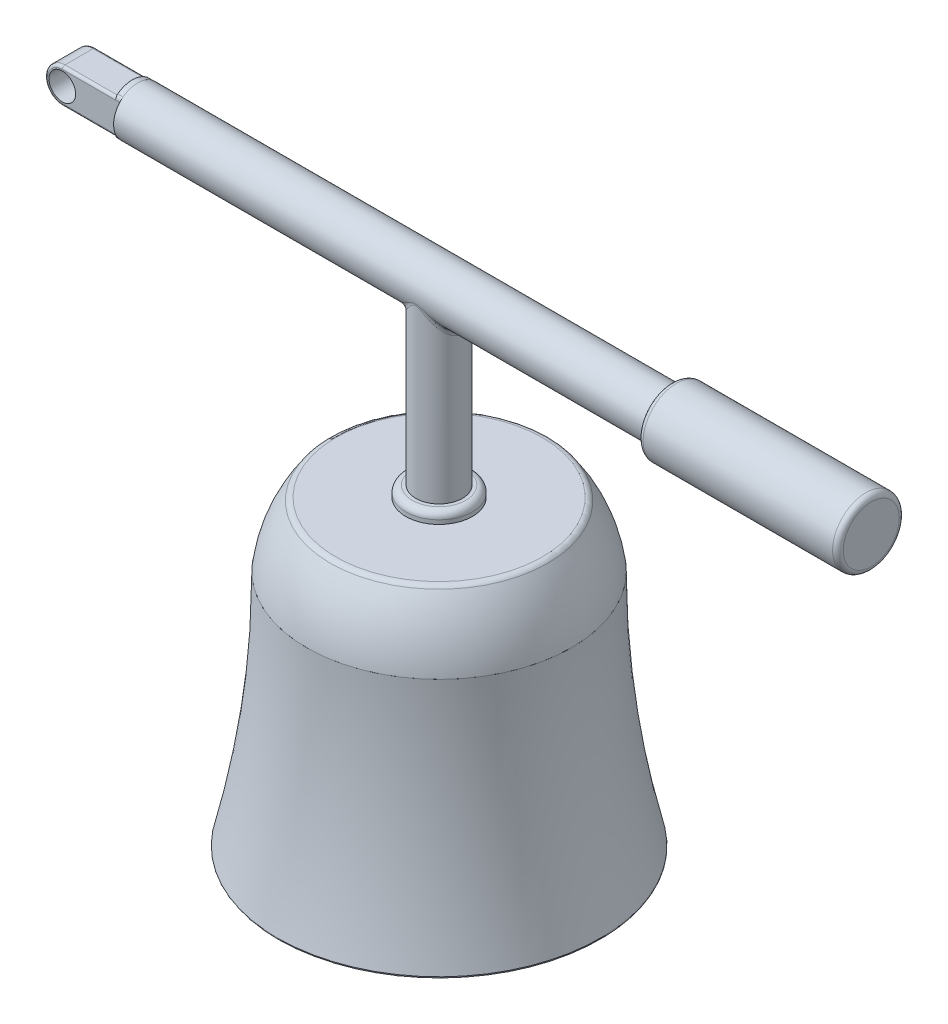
ISO-10303-21;
HEADER;
FILE_DESCRIPTION(('STEP AP214'),'2;1');
FILE_NAME('part.step','',(''),(''),'','','');
FILE_SCHEMA(('AUTOMOTIVE_DESIGN { 1 0 10303 214 1 1 1 1 }'));
ENDSEC;
DATA;
#1=APPLICATION_CONTEXT('core data for automotive mechanical design processes');
#2=APPLICATION_PROTOCOL_DEFINITION('international standard','automotive_design',2000,#1);
#3=PRODUCT_CONTEXT('',#1,'mechanical');
#4=PRODUCT('Part','Part','',(#3));
#5=PRODUCT_RELATED_PRODUCT_CATEGORY('part','',(#4));
#6=PRODUCT_DEFINITION_FORMATION('','',#4);
#7=PRODUCT_DEFINITION_CONTEXT('part definition',#1,'design');
#8=PRODUCT_DEFINITION('design','',#6,#7);
#9=PRODUCT_DEFINITION_SHAPE('','',#8);
#10=(LENGTH_UNIT() NAMED_UNIT(*) SI_UNIT(.MILLI.,.METRE.));
#11=(NAMED_UNIT(*) PLANE_ANGLE_UNIT() SI_UNIT($,.RADIAN.));
#12=(NAMED_UNIT(*) SI_UNIT($,.STERADIAN.) SOLID_ANGLE_UNIT());
#13=UNCERTAINTY_MEASURE_WITH_UNIT(LENGTH_MEASURE(1.E-05),#10,'distance_accuracy_value','');
#14=(GEOMETRIC_REPRESENTATION_CONTEXT(3) GLOBAL_UNCERTAINTY_ASSIGNED_CONTEXT((#13)) GLOBAL_UNIT_ASSIGNED_CONTEXT((#10,
#11,#12)) REPRESENTATION_CONTEXT('',''));
#15=CARTESIAN_POINT('',(0.,0.,0.));
#16=DIRECTION('',(0.,0.,1.));
#17=DIRECTION('',(1.,0.,0.));
#18=AXIS2_PLACEMENT_3D('',#15,#16,#17);
#19=CARTESIAN_POINT('',(27.,-18.9,0.));
#20=DIRECTION('',(0.,-1.,0.));
#21=DIRECTION('',(0.,0.,-1.));
#22=AXIS2_PLACEMENT_3D('',#19,#20,#21);
#23=PLANE('',#22);
#24=CARTESIAN_POINT('',(27.,-18.9,0.));
#25=DIRECTION('',(0.,-1.,0.));
#26=DIRECTION('',(0.,0.,-1.));
#27=AXIS2_PLACEMENT_3D('',#24,#25,#26);
#28=CIRCLE('',#27,4.);
#29=CARTESIAN_POINT('',(27.,-18.9,-4.));
#30=VERTEX_POINT('',#29);
#31=EDGE_CURVE('E11',#30,#30,#28,.T.);
#32=ORIENTED_EDGE('',*,*,#31,.T.);
#33=EDGE_LOOP('',(#32));
#34=FACE_BOUND('',#33,.T.);
#35=CARTESIAN_POINT('',(27.,-18.9,0.));
#36=DIRECTION('',(0.,-1.,0.));
#37=DIRECTION('',(0.,0.,-1.));
#38=AXIS2_PLACEMENT_3D('',#35,#36,#37);
#39=CIRCLE('',#38,3.5);
#40=CARTESIAN_POINT('',(27.,-18.9,-3.5));
#41=VERTEX_POINT('',#40);
#42=EDGE_CURVE('E55',#41,#41,#39,.T.);
#43=ORIENTED_EDGE('',*,*,#42,.F.);
#44=EDGE_LOOP('',(#43));
#45=FACE_BOUND('',#44,.T.);
#46=ADVANCED_FACE('F44',(#34,#45),#23,.T.);
#47=CARTESIAN_POINT('',(27.,-13.9,0.));
#48=DIRECTION('',(0.,-1.,0.));
#49=DIRECTION('',(0.,0.,-1.));
#50=AXIS2_PLACEMENT_3D('',#47,#48,#49);
#51=PLANE('',#50);
#52=CARTESIAN_POINT('',(27.,-13.9,0.));
#53=DIRECTION('',(0.,-1.,0.));
#54=DIRECTION('',(0.,0.,-1.));
#55=AXIS2_PLACEMENT_3D('',#52,#53,#54);
#56=CIRCLE('',#55,4.);
#57=CARTESIAN_POINT('',(27.,-13.9,-4.));
#58=VERTEX_POINT('',#57);
#59=EDGE_CURVE('E48',#58,#58,#56,.T.);
#60=ORIENTED_EDGE('',*,*,#59,.F.);
#61=EDGE_LOOP('',(#60));
#62=FACE_BOUND('',#61,.T.);
#63=CARTESIAN_POINT('',(27.,-13.9,0.));
#64=DIRECTION('',(0.,-1.,0.));
#65=DIRECTION('',(0.,0.,-1.));
#66=AXIS2_PLACEMENT_3D('',#63,#64,#65);
#67=CIRCLE('',#66,3.5);
#68=CARTESIAN_POINT('',(27.,-13.9,-3.5));
#69=VERTEX_POINT('',#68);
#70=EDGE_CURVE('E57',#69,#69,#67,.T.);
#71=ORIENTED_EDGE('',*,*,#70,.T.);
#72=EDGE_LOOP('',(#71));
#73=FACE_BOUND('',#72,.T.);
#74=ADVANCED_FACE('F67',(#62,#73),#51,.F.);
#75=CARTESIAN_POINT('',(27.,-18.9,0.));
#76=DIRECTION('',(0.,1.,0.));
#77=DIRECTION('',(0.,0.,1.));
#78=AXIS2_PLACEMENT_3D('',#75,#76,#77);
#79=CYLINDRICAL_SURFACE('',#78,4.);
#80=ORIENTED_EDGE('',*,*,#31,.F.);
#81=EDGE_LOOP('',(#80));
#82=FACE_BOUND('',#81,.T.);
#83=ORIENTED_EDGE('',*,*,#59,.T.);
#84=EDGE_LOOP('',(#83));
#85=FACE_BOUND('',#84,.T.);
#86=ADVANCED_FACE('F46',(#82,#85),#79,.T.);
#87=CARTESIAN_POINT('',(27.,-18.9,0.));
#88=DIRECTION('',(0.,1.,0.));
#89=DIRECTION('',(0.,0.,1.));
#90=AXIS2_PLACEMENT_3D('',#87,#88,#89);
#91=CYLINDRICAL_SURFACE('',#90,3.5);
#92=ORIENTED_EDGE('',*,*,#42,.T.);
#93=EDGE_LOOP('',(#92));
#94=FACE_BOUND('',#93,.T.);
#95=ORIENTED_EDGE('',*,*,#70,.F.);
#96=EDGE_LOOP('',(#95));
#97=FACE_BOUND('',#96,.T.);
#98=ADVANCED_FACE('F63',(#94,#97),#91,.F.);
#99=CLOSED_SHELL('',(#46,#74,#86,#98));
#100=MANIFOLD_SOLID_BREP('B2',#99);
#101=CARTESIAN_POINT('',(39.1012468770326,-36.4928203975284,0.));
#102=CARTESIAN_POINT('',(36.9282032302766,-27.6440475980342,0.));
#103=CARTESIAN_POINT('',(36.9282032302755,-18.6038475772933,0.));
#104=B_SPLINE_CURVE_WITH_KNOTS('',2,(#101,#102,#103),.UNSPECIFIED.,.F.,.F.,(3,3),(0.,1.),.UNSPECIFIED.);
#105=CARTESIAN_POINT('',(27.,-13.8,0.));
#106=DIRECTION('',(0.,1.,0.));
#107=AXIS1_PLACEMENT('',#105,#106);
#108=SURFACE_OF_REVOLUTION('',#104,#107);
#109=CARTESIAN_POINT('',(27.,-36.3958164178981,0.));
#110=DIRECTION('',(0.,1.,0.));
#111=DIRECTION('',(0.,0.,1.));
#112=AXIS2_PLACEMENT_3D('',#109,#110,#111);
#113=CIRCLE('',#112,12.0774917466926);
#114=CARTESIAN_POINT('',(27.,-36.3958164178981,12.0774917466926));
#115=VERTEX_POINT('',#114);
#116=EDGE_CURVE('E121',#115,#115,#113,.T.);
#117=ORIENTED_EDGE('',*,*,#116,.T.);
#118=EDGE_LOOP('',(#117));
#119=FACE_BOUND('',#118,.T.);
#120=CARTESIAN_POINT('',(27.,-18.6038475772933,0.));
#121=DIRECTION('',(0.,1.,0.));
#122=DIRECTION('',(0.,0.,1.));
#123=AXIS2_PLACEMENT_3D('',#120,#121,#122);
#124=CIRCLE('',#123,9.9282032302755);
#125=CARTESIAN_POINT('',(27.,-18.6038475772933,9.9282032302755));
#126=VERTEX_POINT('',#125);
#127=EDGE_CURVE('E134',#126,#126,#124,.T.);
#128=ORIENTED_EDGE('',*,*,#127,.F.);
#129=EDGE_LOOP('',(#128));
#130=FACE_BOUND('',#129,.T.);
#131=ADVANCED_FACE('F114',(#119,#130),#108,.T.);
#132=CARTESIAN_POINT('',(27.,-36.5166693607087,0.));
#133=DIRECTION('',(0.,1.,0.));
#134=DIRECTION('',(0.,0.,1.));
#135=AXIS2_PLACEMENT_3D('',#132,#133,#134);
#136=CONICAL_SURFACE('',#135,12.0041323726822,1.32998601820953);
#137=CARTESIAN_POINT('',(27.,-36.5166538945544,0.));
#138=DIRECTION('',(0.,-1.,0.));
#139=DIRECTION('',(0.,0.,-1.));
#140=AXIS2_PLACEMENT_3D('',#137,#138,#139);
#141=CIRCLE('',#140,12.0041953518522);
#142=CARTESIAN_POINT('',(27.,-36.5166538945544,-12.0041953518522));
#143=VERTEX_POINT('',#142);
#144=EDGE_CURVE('E43',#143,#143,#141,.T.);
#145=ORIENTED_EDGE('',*,*,#144,.T.);
#146=EDGE_LOOP('',(#145));
#147=FACE_BOUND('',#146,.T.);
#148=CARTESIAN_POINT('',(27.,-36.5166693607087,0.));
#149=DIRECTION('',(0.,1.,0.));
#150=DIRECTION('',(0.,0.,1.));
#151=AXIS2_PLACEMENT_3D('',#148,#149,#150);
#152=CIRCLE('',#151,12.0041323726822);
#153=CARTESIAN_POINT('',(27.,-36.5166693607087,12.0041323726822));
#154=VERTEX_POINT('',#153);
#155=EDGE_CURVE('E125',#154,#154,#152,.T.);
#156=ORIENTED_EDGE('',*,*,#155,.T.);
#157=EDGE_LOOP('',(#156));
#158=FACE_BOUND('',#157,.T.);
#159=ADVANCED_FACE('F153',(#147,#158),#136,.T.);
#160=CARTESIAN_POINT('',(36.8282032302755,-18.6038475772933,0.));
#161=CARTESIAN_POINT('',(36.8282032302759,-21.6107873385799,0.));
#162=CARTESIAN_POINT('',(37.1006052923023,-26.1275307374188,0.));
#163=CARTESIAN_POINT('',(38.006171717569,-32.0752682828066,0.));
#164=CARTESIAN_POINT('',(38.6429766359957,-35.0460200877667,0.));
#165=CARTESIAN_POINT('',(39.0041323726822,-36.5166693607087,0.));
#166=B_SPLINE_CURVE_WITH_KNOTS('',3,(#160,#161,#162,#163,#164,#165),.UNSPECIFIED.,.F.,.F.,(4,1,
1,4),(0.,0.5,0.75,1.),.UNSPECIFIED.);
#167=CARTESIAN_POINT('',(27.,-13.8,0.));
#168=DIRECTION('',(0.,1.,0.));
#169=AXIS1_PLACEMENT('',#167,#168);
#170=SURFACE_OF_REVOLUTION('',#166,#169);
#171=ORIENTED_EDGE('',*,*,#155,.F.);
#172=EDGE_LOOP('',(#171));
#173=FACE_BOUND('',#172,.T.);
#174=CARTESIAN_POINT('',(27.,-18.6038475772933,0.));
#175=DIRECTION('',(0.,1.,0.));
#176=DIRECTION('',(0.,0.,1.));
#177=AXIS2_PLACEMENT_3D('',#174,#175,#176);
#178=CIRCLE('',#177,9.8282032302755);
#179=CARTESIAN_POINT('',(27.,-18.6038475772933,9.8282032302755));
#180=VERTEX_POINT('',#179);
#181=EDGE_CURVE('E129',#180,#180,#178,.T.);
#182=ORIENTED_EDGE('',*,*,#181,.T.);
#183=EDGE_LOOP('',(#182));
#184=FACE_BOUND('',#183,.T.);
#185=ADVANCED_FACE('F148',(#173,#184),#170,.T.);
#186=CARTESIAN_POINT('',(36.9282032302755,-18.6038475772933,0.));
#187=DIRECTION('',(0.,-1.,0.));
#188=DIRECTION('',(0.,0.,-1.));
#189=AXIS2_PLACEMENT_3D('',#186,#187,#188);
#190=PLANE('',#189);
#191=ORIENTED_EDGE('',*,*,#181,.F.);
#192=EDGE_LOOP('',(#191));
#193=FACE_BOUND('',#192,.T.);
#194=ORIENTED_EDGE('',*,*,#127,.T.);
#195=EDGE_LOOP('',(#194));
#196=FACE_BOUND('',#195,.T.);
#197=ADVANCED_FACE('F152',(#193,#196),#190,.F.);
#198=CARTESIAN_POINT('',(27.,-36.419539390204,0.));
#199=DIRECTION('',(0.,-1.,0.));
#200=DIRECTION('',(0.,0.,-1.));
#201=AXIS2_PLACEMENT_3D('',#198,#199,#200);
#202=TOROIDAL_SURFACE('',#201,11.9803463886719,0.1);
#203=ORIENTED_EDGE('',*,*,#144,.F.);
#204=EDGE_LOOP('',(#203));
#205=FACE_BOUND('',#204,.T.);
#206=ORIENTED_EDGE('',*,*,#116,.F.);
#207=EDGE_LOOP('',(#206));
#208=FACE_BOUND('',#207,.T.);
#209=ADVANCED_FACE('F116',(#205,#208),#202,.T.);
#210=CLOSED_SHELL('',(#131,#159,#185,#197,#209));
#211=MANIFOLD_SOLID_BREP('B6',#210);
#212=CARTESIAN_POINT('',(27.,-13.8,0.));
#213=DIRECTION('',(0.,-1.,0.));
#214=DIRECTION('',(0.,0.,-1.));
#215=AXIS2_PLACEMENT_3D('',#212,#213,#214);
#216=PLANE('',#215);
#217=CARTESIAN_POINT('',(27.,-13.8,0.));
#218=DIRECTION('',(0.,-1.,0.));
#219=DIRECTION('',(0.,0.,-1.));
#220=AXIS2_PLACEMENT_3D('',#217,#218,#219);
#221=CIRCLE('',#220,7.74596669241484);
#222=CARTESIAN_POINT('',(27.,-13.8,-7.74596669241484));
#223=VERTEX_POINT('',#222);
#224=EDGE_CURVE('E220',#223,#223,#221,.F.);
#225=ORIENTED_EDGE('',*,*,#224,.T.);
#226=EDGE_LOOP('',(#225));
#227=FACE_BOUND('',#226,.T.);
#228=ADVANCED_FACE('F213',(#227),#216,.F.);
#229=CARTESIAN_POINT('',(27.,-19.8,0.));
#230=DIRECTION('',(0.,1.,0.));
#231=DIRECTION('',(1.,0.,0.));
#232=AXIS2_PLACEMENT_3D('',#229,#230,#231);
#233=SPHERICAL_SURFACE('',#232,10.);
#234=CARTESIAN_POINT('',(27.,-14.0105263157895,0.));
#235=DIRECTION('',(0.,-1.,0.));
#236=DIRECTION('',(0.,0.,-1.));
#237=AXIS2_PLACEMENT_3D('',#234,#235,#236);
#238=CIRCLE('',#237,8.15364914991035);
#239=CARTESIAN_POINT('',(35.1536491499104,-14.0105263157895,0.));
#240=VERTEX_POINT('',#239);
#241=EDGE_CURVE('E113',#240,#240,#238,.T.);
#242=CARTESIAN_POINT('',(27.,-18.6038475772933,0.));
#243=DIRECTION('',(0.,1.,0.));
#244=DIRECTION('',(0.,0.,1.));
#245=AXIS2_PLACEMENT_3D('',#242,#243,#244);
#246=CIRCLE('',#245,9.9282032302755);
#247=CARTESIAN_POINT('',(36.9282032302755,-18.6038475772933,0.));
#248=VERTEX_POINT('',#247);
#249=EDGE_CURVE('E224',#248,#248,#246,.T.);
#250=CARTESIAN_POINT('',(35.1536491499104,-14.0105263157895,0.));
#251=CARTESIAN_POINT('',(35.1836540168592,-14.0527838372,0.));
#252=CARTESIAN_POINT('',(35.2133303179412,-14.0952746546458,0.));
#253=CARTESIAN_POINT('',(35.2720187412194,-14.1807125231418,0.));
#254=CARTESIAN_POINT('',(35.3010308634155,-14.223659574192,0.));
#255=CARTESIAN_POINT('',(35.3583838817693,-14.3099995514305,0.));
#256=CARTESIAN_POINT('',(35.386724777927,-14.3533924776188,0.));
#257=CARTESIAN_POINT('',(35.4427285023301,-14.4406137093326,0.));
#258=CARTESIAN_POINT('',(35.4703913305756,-14.4844420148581,0.));
#259=CARTESIAN_POINT('',(35.5250322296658,-14.5725234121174,0.));
#260=CARTESIAN_POINT('',(35.5520103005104,-14.6167765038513,0.));
#261=CARTESIAN_POINT('',(35.6052751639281,-14.7056967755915,0.));
#262=CARTESIAN_POINT('',(35.6315619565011,-14.750363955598,0.));
#263=CARTESIAN_POINT('',(35.6834379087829,-14.8401016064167,0.));
#264=CARTESIAN_POINT('',(35.7090270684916,-14.885172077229,0.));
#265=CARTESIAN_POINT('',(35.7595015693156,-14.9757054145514,0.));
#266=CARTESIAN_POINT('',(35.7843869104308,-15.0211682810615,0.));
#267=CARTESIAN_POINT('',(35.8334477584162,-15.1124754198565,0.));
#268=CARTESIAN_POINT('',(35.8576232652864,-15.1583196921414,0.));
#269=CARTESIAN_POINT('',(35.9052586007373,-15.2503785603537,0.));
#270=CARTESIAN_POINT('',(35.928718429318,-15.2965931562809,0.));
#271=CARTESIAN_POINT('',(35.9749167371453,-15.3893815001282,0.));
#272=CARTESIAN_POINT('',(35.9976552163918,-15.4359552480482,0.));
#273=CARTESIAN_POINT('',(36.0424053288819,-15.5294506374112,0.));
#274=CARTESIAN_POINT('',(36.0644169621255,-15.5763722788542,0.));
#275=CARTESIAN_POINT('',(36.1077080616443,-15.6705521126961,0.));
#276=CARTESIAN_POINT('',(36.1289875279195,-15.7178103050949,0.));
#277=CARTESIAN_POINT('',(36.1708091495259,-15.812651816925,0.));
#278=CARTESIAN_POINT('',(36.1913513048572,-15.8602351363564,0.));
#279=CARTESIAN_POINT('',(36.2316933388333,-15.9557153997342,0.));
#280=CARTESIAN_POINT('',(36.2514932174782,-16.0036123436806,0.));
#281=CARTESIAN_POINT('',(36.2903459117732,-16.0997082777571,0.));
#282=CARTESIAN_POINT('',(36.3093987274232,-16.1479072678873,0.));
#283=CARTESIAN_POINT('',(36.3467526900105,-16.2445956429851,0.));
#284=CARTESIAN_POINT('',(36.3650538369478,-16.2930850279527,0.));
#285=CARTESIAN_POINT('',(36.4009000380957,-16.3903424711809,0.));
#286=CARTESIAN_POINT('',(36.4184450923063,-16.4391105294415,0.));
#287=CARTESIAN_POINT('',(36.4527748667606,-16.536913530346,0.));
#288=CARTESIAN_POINT('',(36.4695595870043,-16.58594847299,0.));
#289=CARTESIAN_POINT('',(36.5023646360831,-16.6842733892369,0.));
#290=CARTESIAN_POINT('',(36.5183849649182,-16.7335633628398,0.));
#291=CARTESIAN_POINT('',(36.549657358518,-16.8323864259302,0.));
#292=CARTESIAN_POINT('',(36.5649094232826,-16.8819195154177,0.));
#293=CARTESIAN_POINT('',(36.594641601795,-16.9812168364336,0.));
#294=CARTESIAN_POINT('',(36.6091217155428,-17.0309810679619,0.));
#295=CARTESIAN_POINT('',(36.6373064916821,-17.130728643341,0.));
#296=CARTESIAN_POINT('',(36.6510111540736,-17.1807119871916,0.));
#297=CARTESIAN_POINT('',(36.6776417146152,-17.2808857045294,0.));
#298=CARTESIAN_POINT('',(36.6905676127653,-17.3310760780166,0.));
#299=CARTESIAN_POINT('',(36.715637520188,-17.4316517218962,0.));
#300=CARTESIAN_POINT('',(36.7277815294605,-17.4820369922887,0.));
#301=CARTESIAN_POINT('',(36.7512847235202,-17.5829902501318,0.));
#302=CARTESIAN_POINT('',(36.7626439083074,-17.6335582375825,0.));
#303=CARTESIAN_POINT('',(36.7845747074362,-17.7348647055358,0.));
#304=CARTESIAN_POINT('',(36.7951463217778,-17.7856031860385,0.));
#305=CARTESIAN_POINT('',(36.8154994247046,-17.887238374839,0.));
#306=CARTESIAN_POINT('',(36.8252809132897,-17.9381350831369,0.));
#307=CARTESIAN_POINT('',(36.8440513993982,-18.0400744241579,0.));
#308=CARTESIAN_POINT('',(36.8530403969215,-18.0911170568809,0.));
#309=CARTESIAN_POINT('',(36.8702237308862,-18.1933359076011,0.));
#310=CARTESIAN_POINT('',(36.8784180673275,-18.2445121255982,0.));
#311=CARTESIAN_POINT('',(36.894010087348,-18.3469857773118,0.));
#312=CARTESIAN_POINT('',(36.9014077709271,-18.3982832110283,0.));
#313=CARTESIAN_POINT('',(36.9154047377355,-18.5009868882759,0.));
#314=CARTESIAN_POINT('',(36.9220040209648,-18.5523931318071,0.));
#315=CARTESIAN_POINT('',(36.9282032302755,-18.6038475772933,0.));
#316=B_SPLINE_CURVE_WITH_KNOTS('',3,(#250,#251,#252,#253,#254,#255,#256,#257,#258,#259,#260,
#261,#262,#263,#264,#265,#266,#267,#268,#269,#270,#271,#272,#273,#274,#275,#276,#277,#278,#279,
#280,#281,#282,#283,#284,#285,#286,#287,#288,#289,#290,#291,#292,#293,#294,#295,#296,#297,#298,
#299,#300,#301,#302,#303,#304,#305,#306,#307,#308,#309,#310,#311,#312,#313,#314,#315),
.UNSPECIFIED.,.F.,.F.,(4,2,2,2,2,2,2,2,2,2,2,2,2,2,2,2,2,2,2,2,2,2,2,2,2,2,2,2,2,2,2,2,4),(0.,
0.155478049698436,0.310956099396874,0.466434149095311,0.621912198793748,0.777390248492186,
0.932868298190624,1.08834634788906,1.2438243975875,1.39930244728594,1.55478049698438,
1.71025854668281,1.86573659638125,2.02121464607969,2.17669269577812,2.33217074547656,
2.487648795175,2.64312684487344,2.79860489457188,2.95408294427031,3.10956099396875,
3.26503904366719,3.42051709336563,3.57599514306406,3.7314731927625,3.88695124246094,
4.04242929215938,4.19790734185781,4.35338539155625,4.50886344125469,4.66434149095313,
4.81981954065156,4.97529759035),.UNSPECIFIED.);
#317=EDGE_CURVE('BSEAM255',#240,#248,#316,.T.);
#318=ORIENTED_EDGE('',*,*,#241,.T.);
#319=ORIENTED_EDGE('',*,*,#249,.T.);
#320=ORIENTED_EDGE('',*,*,#317,.T.);
#321=ORIENTED_EDGE('',*,*,#317,.F.);
#322=EDGE_LOOP('',(#318,#320,#319,#321));
#323=FACE_BOUND('',#322,.T.);
#324=ADVANCED_FACE('F255',(#323),#233,.T.);
#325=CARTESIAN_POINT('',(27.,-18.6038475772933,0.));
#326=DIRECTION('',(0.,1.,0.));
#327=DIRECTION('',(0.,0.,1.));
#328=AXIS2_PLACEMENT_3D('',#325,#326,#327);
#329=PLANE('',#328);
#330=CARTESIAN_POINT('',(27.,-18.6038475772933,0.));
#331=DIRECTION('',(0.,1.,0.));
#332=DIRECTION('',(0.,0.,1.));
#333=AXIS2_PLACEMENT_3D('',#330,#331,#332);
#334=CIRCLE('',#333,9.82747268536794);
#335=CARTESIAN_POINT('',(36.8274726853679,-18.6038475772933,0.));
#336=VERTEX_POINT('',#335);
#337=EDGE_CURVE('E231',#336,#336,#334,.T.);
#338=ORIENTED_EDGE('',*,*,#337,.T.);
#339=EDGE_LOOP('',(#338));
#340=FACE_BOUND('',#339,.T.);
#341=ORIENTED_EDGE('',*,*,#249,.F.);
#342=EDGE_LOOP('',(#341));
#343=FACE_BOUND('',#342,.T.);
#344=ADVANCED_FACE('F252',(#340,#343),#329,.F.);
#345=CARTESIAN_POINT('',(27.,-14.3,0.));
#346=DIRECTION('',(0.,-1.,0.));
#347=DIRECTION('',(0.,0.,-1.));
#348=AXIS2_PLACEMENT_3D('',#345,#346,#347);
#349=TOROIDAL_SURFACE('',#348,7.74596669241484,0.5);
#350=ORIENTED_EDGE('',*,*,#241,.F.);
#351=EDGE_LOOP('',(#350));
#352=FACE_BOUND('',#351,.T.);
#353=ORIENTED_EDGE('',*,*,#224,.F.);
#354=EDGE_LOOP('',(#353));
#355=FACE_BOUND('',#354,.T.);
#356=ADVANCED_FACE('F215',(#352,#355),#349,.T.);
#357=CARTESIAN_POINT('',(27.,-13.9,0.));
#358=DIRECTION('',(0.,-1.,0.));
#359=DIRECTION('',(0.,0.,-1.));
#360=AXIS2_PLACEMENT_3D('',#357,#358,#359);
#361=PLANE('',#360);
#362=CARTESIAN_POINT('',(27.,-13.9,0.));
#363=DIRECTION('',(0.,-1.,0.));
#364=DIRECTION('',(0.,0.,-1.));
#365=AXIS2_PLACEMENT_3D('',#362,#363,#364);
#366=CIRCLE('',#365,7.74596669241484);
#367=CARTESIAN_POINT('',(27.,-13.9,-7.74596669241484));
#368=VERTEX_POINT('',#367);
#369=EDGE_CURVE('E234',#368,#368,#366,.F.);
#370=ORIENTED_EDGE('',*,*,#369,.F.);
#371=EDGE_LOOP('',(#370));
#372=FACE_BOUND('',#371,.T.);
#373=ADVANCED_FACE('F242',(#372),#361,.T.);
#374=CARTESIAN_POINT('',(27.,-19.8,0.));
#375=DIRECTION('',(0.,1.,0.));
#376=DIRECTION('',(1.,0.,0.));
#377=AXIS2_PLACEMENT_3D('',#374,#375,#376);
#378=SPHERICAL_SURFACE('',#377,9.9);
#379=CARTESIAN_POINT('',(27.,-14.0684210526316,0.));
#380=DIRECTION('',(0.,1.,0.));
#381=DIRECTION('',(0.,0.,1.));
#382=AXIS2_PLACEMENT_3D('',#379,#380,#381);
#383=CIRCLE('',#382,8.07211265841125);
#384=CARTESIAN_POINT('',(35.0721126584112,-14.0684210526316,0.));
#385=VERTEX_POINT('',#384);
#386=EDGE_CURVE('E228',#385,#385,#383,.F.);
#387=CARTESIAN_POINT('',(35.0721126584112,-14.0684210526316,0.));
#388=CARTESIAN_POINT('',(35.1017448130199,-14.1101536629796,0.));
#389=CARTESIAN_POINT('',(35.1310532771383,-14.1521161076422,0.));
#390=CARTESIAN_POINT('',(35.189015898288,-14.236490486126,0.));
#391=CARTESIAN_POINT('',(35.2176700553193,-14.2789024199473,0.));
#392=CARTESIAN_POINT('',(35.2743171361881,-14.3641655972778,0.));
#393=CARTESIAN_POINT('',(35.3023100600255,-14.407016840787,0.));
#394=CARTESIAN_POINT('',(35.3576279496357,-14.4931483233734,0.));
#395=CARTESIAN_POINT('',(35.3849529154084,-14.5364285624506,0.));
#396=CARTESIAN_POINT('',(35.4389283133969,-14.6234076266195,0.));
#397=CARTESIAN_POINT('',(35.4655787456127,-14.6671064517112,0.));
#398=CARTESIAN_POINT('',(35.5181986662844,-14.7549121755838,0.));
#399=CARTESIAN_POINT('',(35.5441681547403,-14.7990190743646,0.));
#400=CARTESIAN_POINT('',(35.5954199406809,-14.8876303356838,0.));
#401=CARTESIAN_POINT('',(35.6207022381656,-14.9321346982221,0.));
#402=CARTESIAN_POINT('',(35.6705735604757,-15.0215301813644,0.));
#403=CARTESIAN_POINT('',(35.6951625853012,-15.0664213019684,0.));
#404=CARTESIAN_POINT('',(35.7436414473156,-15.1565795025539,0.));
#405=CARTESIAN_POINT('',(35.7675312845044,-15.2018465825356,0.));
#406=CARTESIAN_POINT('',(35.8146060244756,-15.29274581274,0.));
#407=CARTESIAN_POINT('',(35.8377909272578,-15.3383779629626,0.));
#408=CARTESIAN_POINT('',(35.8834502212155,-15.4299963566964,0.));
#409=CARTESIAN_POINT('',(35.905924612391,-15.4759826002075,0.));
#410=CARTESIAN_POINT('',(35.9501574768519,-15.5682981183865,0.));
#411=CARTESIAN_POINT('',(35.9719159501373,-15.6146273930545,0.));
#412=CARTESIAN_POINT('',(36.0147117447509,-15.7076178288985,0.));
#413=CARTESIAN_POINT('',(36.035749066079,-15.7542789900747,0.));
#414=CARTESIAN_POINT('',(36.077097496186,-15.8479219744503,0.));
#415=CARTESIAN_POINT('',(36.0974086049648,-15.8949037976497,0.));
#416=CARTESIAN_POINT('',(36.137299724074,-15.9891768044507,0.));
#417=CARTESIAN_POINT('',(36.1568797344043,-16.0364679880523,0.));
#418=CARTESIAN_POINT('',(36.1953039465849,-16.1313483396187,0.));
#419=CARTESIAN_POINT('',(36.2141481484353,-16.1789375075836,0.));
#420=CARTESIAN_POINT('',(36.2510962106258,-16.2744023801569,0.));
#421=CARTESIAN_POINT('',(36.269200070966,-16.3222780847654,0.));
#422=CARTESIAN_POINT('',(36.304663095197,-16.4183045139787,0.));
#423=CARTESIAN_POINT('',(36.322022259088,-16.4664552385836,0.));
#424=CARTESIAN_POINT('',(36.3559917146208,-16.5630201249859,0.));
#425=CARTESIAN_POINT('',(36.3726020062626,-16.6114342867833,0.));
#426=CARTESIAN_POINT('',(36.4050697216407,-16.7085144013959,0.));
#427=CARTESIAN_POINT('',(36.420927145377,-16.7571803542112,0.));
#428=CARTESIAN_POINT('',(36.4518853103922,-16.8547523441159,0.));
#429=CARTESIAN_POINT('',(36.4669860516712,-16.9036583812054,0.));
#430=CARTESIAN_POINT('',(36.4964272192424,-17.0016987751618,0.));
#431=CARTESIAN_POINT('',(36.5107676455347,-17.0508331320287,0.));
#432=CARTESIAN_POINT('',(36.5386847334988,-17.1493183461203,0.));
#433=CARTESIAN_POINT('',(36.5522613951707,-17.198669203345,0.));
#434=CARTESIAN_POINT('',(36.5786476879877,-17.2975755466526,0.));
#435=CARTESIAN_POINT('',(36.5914573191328,-17.3471310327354,0.));
#436=CARTESIAN_POINT('',(36.6163064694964,-17.446434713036,0.));
#437=CARTESIAN_POINT('',(36.6283459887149,-17.4961829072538,0.));
#438=CARTESIAN_POINT('',(36.6516520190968,-17.5958600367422,0.));
#439=CARTESIAN_POINT('',(36.6629185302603,-17.6457889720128,0.));
#440=CARTESIAN_POINT('',(36.6846758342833,-17.7458155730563,0.));
#441=CARTESIAN_POINT('',(36.6951666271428,-17.7959132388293,0.));
#442=CARTESIAN_POINT('',(36.7153699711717,-17.8962652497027,0.));
#443=CARTESIAN_POINT('',(36.7250825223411,-17.9465195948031,0.));
#444=CARTESIAN_POINT('',(36.7437270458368,-18.0471728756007,0.));
#445=CARTESIAN_POINT('',(36.7526590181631,-18.097571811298,0.));
#446=CARTESIAN_POINT('',(36.7697402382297,-18.1985021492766,0.));
#447=CARTESIAN_POINT('',(36.7778894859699,-18.2490335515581,0.));
#448=CARTESIAN_POINT('',(36.7934032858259,-18.3502166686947,0.));
#449=CARTESIAN_POINT('',(36.8007678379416,-18.4008683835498,0.));
#450=CARTESIAN_POINT('',(36.8147105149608,-18.5022799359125,0.));
#451=CARTESIAN_POINT('',(36.8212886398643,-18.5530397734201,0.));
#452=CARTESIAN_POINT('',(36.8274726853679,-18.6038475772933,0.));
#453=B_SPLINE_CURVE_WITH_KNOTS('',3,(#387,#388,#389,#390,#391,#392,#393,#394,#395,#396,#397,
#398,#399,#400,#401,#402,#403,#404,#405,#406,#407,#408,#409,#410,#411,#412,#413,#414,#415,#416,
#417,#418,#419,#420,#421,#422,#423,#424,#425,#426,#427,#428,#429,#430,#431,#432,#433,#434,#435,
#436,#437,#438,#439,#440,#441,#442,#443,#444,#445,#446,#447,#448,#449,#450,#451,#452),
.UNSPECIFIED.,.F.,.F.,(4,2,2,2,2,2,2,2,2,2,2,2,2,2,2,2,2,2,2,2,2,2,2,2,2,2,2,2,2,2,2,2,4),(0.,
0.153546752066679,0.307093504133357,0.460640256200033,0.614187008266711,0.76773376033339,
0.921280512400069,1.07482726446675,1.22837401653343,1.3819207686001,1.53546752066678,
1.68901427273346,1.84256102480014,1.99610777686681,2.14965452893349,2.30320128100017,
2.45674803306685,2.61029478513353,2.7638415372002,2.91738828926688,3.07093504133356,
3.22448179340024,3.37802854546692,3.5315752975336,3.68512204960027,3.83866880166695,
3.99221555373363,4.14576230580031,4.29930905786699,4.45285580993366,4.60640256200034,
4.75994931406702,4.9134960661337),.UNSPECIFIED.);
#454=EDGE_CURVE('BSEAM244',#385,#336,#453,.T.);
#455=ORIENTED_EDGE('',*,*,#386,.F.);
#456=ORIENTED_EDGE('',*,*,#337,.F.);
#457=ORIENTED_EDGE('',*,*,#454,.T.);
#458=ORIENTED_EDGE('',*,*,#454,.F.);
#459=EDGE_LOOP('',(#455,#457,#456,#458));
#460=FACE_BOUND('',#459,.T.);
#461=ADVANCED_FACE('F244',(#460),#378,.F.);
#462=CARTESIAN_POINT('',(27.,-14.3,0.));
#463=DIRECTION('',(0.,-1.,0.));
#464=DIRECTION('',(0.,0.,-1.));
#465=AXIS2_PLACEMENT_3D('',#462,#463,#464);
#466=TOROIDAL_SURFACE('',#465,7.74596669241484,0.4);
#467=ORIENTED_EDGE('',*,*,#386,.T.);
#468=EDGE_LOOP('',(#467));
#469=FACE_BOUND('',#468,.T.);
#470=ORIENTED_EDGE('',*,*,#369,.T.);
#471=EDGE_LOOP('',(#470));
#472=FACE_BOUND('',#471,.T.);
#473=ADVANCED_FACE('F240',(#469,#472),#466,.F.);
#474=CLOSED_SHELL('',(#228,#324,#344,#356,#373,#461,#473));
#475=MANIFOLD_SOLID_BREP('B38',#474);
#476=CARTESIAN_POINT('',(44.4,0.,0.));
#477=DIRECTION('',(-1.,0.,0.));
#478=DIRECTION('',(0.,0.,1.));
#479=AXIS2_PLACEMENT_3D('',#476,#477,#478);
#480=CYLINDRICAL_SURFACE('',#479,1.80346887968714);
#481=CARTESIAN_POINT('',(26.9154667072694,-0.391949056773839,1.76036244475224));
#482=CARTESIAN_POINT('',(26.924976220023,-0.445605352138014,1.74841573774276));
#483=CARTESIAN_POINT('',(26.9342518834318,-0.500614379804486,1.74876447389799));
#484=CARTESIAN_POINT('',(26.9434125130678,-0.388257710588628,1.76118469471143));
#485=CARTESIAN_POINT('',(26.9497679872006,-0.441435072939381,1.74946280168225));
#486=CARTESIAN_POINT('',(26.9559875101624,-0.495899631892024,1.74958130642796));
#487=CARTESIAN_POINT('',(26.9717723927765,-0.386315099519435,1.76160741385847));
#488=CARTESIAN_POINT('',(26.9749456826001,-0.43923798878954,1.75000158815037));
#489=CARTESIAN_POINT('',(26.9780451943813,-0.493418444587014,1.75000124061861));
#490=CARTESIAN_POINT('',(27.0284688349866,-0.386326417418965,1.7616049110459));
#491=CARTESIAN_POINT('',(27.0252684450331,-0.43925076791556,1.74999840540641));
#492=CARTESIAN_POINT('',(27.0221424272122,-0.493432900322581,1.74999875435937));
#493=CARTESIAN_POINT('',(27.056805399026,-0.388277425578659,1.76118032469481));
#494=CARTESIAN_POINT('',(27.0504254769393,-0.441457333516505,1.74945724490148));
#495=CARTESIAN_POINT('',(27.0441819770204,-0.49592481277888,1.74957696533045));
#496=CARTESIAN_POINT('',(27.1208617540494,-0.396759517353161,1.75929088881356));
#497=CARTESIAN_POINT('',(27.1072690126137,-0.45104284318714,1.74705047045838));
#498=CARTESIAN_POINT('',(27.0940035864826,-0.506758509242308,1.74769997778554));
#499=CARTESIAN_POINT('',(27.1563029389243,-0.404468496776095,1.75755690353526));
#500=CARTESIAN_POINT('',(27.1387163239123,-0.459758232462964,1.74484058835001));
#501=CARTESIAN_POINT('',(27.1215689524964,-0.5166047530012,1.74597741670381));
#502=CARTESIAN_POINT('',(27.2252812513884,-0.423921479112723,1.75296585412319));
#503=CARTESIAN_POINT('',(27.1998581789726,-0.481716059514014,1.73899685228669));
#504=CARTESIAN_POINT('',(27.1752187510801,-0.541450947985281,1.74141661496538));
#505=CARTESIAN_POINT('',(27.2588068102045,-0.435687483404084,1.75010265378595));
#506=CARTESIAN_POINT('',(27.2295585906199,-0.494995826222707,1.73535156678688));
#507=CARTESIAN_POINT('',(27.2012941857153,-0.556479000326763,1.7385722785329));
#508=CARTESIAN_POINT('',(27.3399258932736,-0.467971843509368,1.74180789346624));
#509=CARTESIAN_POINT('',(27.3013610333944,-0.53138609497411,1.72480014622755));
#510=CARTESIAN_POINT('',(27.2643868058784,-0.59771398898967,1.73033216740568));
#511=CARTESIAN_POINT('',(27.3864363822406,-0.48996454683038,1.73580440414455));
#512=CARTESIAN_POINT('',(27.3424582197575,-0.556148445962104,1.7171648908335));
#513=CARTESIAN_POINT('',(27.3005616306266,-0.625804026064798,1.72436823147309));
#514=CARTESIAN_POINT('',(27.4768315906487,-0.536579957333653,1.72197037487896));
#515=CARTESIAN_POINT('',(27.4221218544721,-0.608461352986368,1.69961714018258));
#516=CARTESIAN_POINT('',(27.3708690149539,-0.685343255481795,1.7106253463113));
#517=CARTESIAN_POINT('',(27.5207093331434,-0.561209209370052,1.71413522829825));
#518=CARTESIAN_POINT('',(27.460710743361,-0.636055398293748,1.6896813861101));
#519=CARTESIAN_POINT('',(27.4049961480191,-0.716800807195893,1.70284182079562));
#520=CARTESIAN_POINT('',(27.6068318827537,-0.611947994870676,1.69668610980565));
#521=CARTESIAN_POINT('',(27.5362034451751,-0.692688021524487,1.66761952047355));
#522=CARTESIAN_POINT('',(27.471980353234,-0.781606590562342,1.6855076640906));
#523=CARTESIAN_POINT('',(27.6490663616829,-0.638064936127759,1.68706257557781));
#524=CARTESIAN_POINT('',(27.5731221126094,-0.721766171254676,1.65546091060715));
#525=CARTESIAN_POINT('',(27.5048293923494,-0.814964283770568,1.67594753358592));
#526=CARTESIAN_POINT('',(27.7320645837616,-0.690944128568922,1.66610531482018));
#527=CARTESIAN_POINT('',(27.6453802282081,-0.780381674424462,1.62907515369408));
#528=CARTESIAN_POINT('',(27.5693835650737,-0.882503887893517,1.65512834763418));
#529=CARTESIAN_POINT('',(27.7728298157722,-0.717705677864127,1.65477338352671));
#530=CARTESIAN_POINT('',(27.6807452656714,-0.809948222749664,1.61482583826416));
#531=CARTESIAN_POINT('',(27.6010898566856,-0.916684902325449,1.64387107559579));
#532=CARTESIAN_POINT('',(27.8870869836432,-0.794166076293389,1.62010921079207));
#533=CARTESIAN_POINT('',(27.7796606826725,-0.894218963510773,1.57127962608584));
#534=CARTESIAN_POINT('',(27.6899565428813,-1.01434344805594,1.60943528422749));
#535=CARTESIAN_POINT('',(27.9592210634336,-0.844197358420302,1.59470913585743));
#536=CARTESIAN_POINT('',(27.8414411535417,-0.948800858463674,1.5395118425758));
#537=CARTESIAN_POINT('',(27.7460608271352,-1.07824557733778,1.58420255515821));
#538=CARTESIAN_POINT('',(28.1001727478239,-0.943741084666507,1.53790577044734));
#539=CARTESIAN_POINT('',(27.9606617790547,-1.0559747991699,1.46927168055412));
#540=CARTESIAN_POINT('',(27.8556899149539,-1.20538715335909,1.52777343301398));
#541=CARTESIAN_POINT('',(28.1689874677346,-0.993253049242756,1.50649737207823));
#542=CARTESIAN_POINT('',(28.0181992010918,-1.10868668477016,1.43058503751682));
#543=CARTESIAN_POINT('',(27.9092124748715,-1.26862598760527,1.49657196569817));
#544=CARTESIAN_POINT('',(28.3697174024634,-1.13918449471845,1.40317542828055));
#545=CARTESIAN_POINT('',(28.1846233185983,-1.26263402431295,1.30388422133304));
#546=CARTESIAN_POINT('',(28.0653357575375,-1.45501597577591,1.39393074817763));
#547=CARTESIAN_POINT('',(28.4967294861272,-1.23356653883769,1.32192362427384));
#548=CARTESIAN_POINT('',(28.2852531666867,-1.35786963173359,1.2057837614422));
#549=CARTESIAN_POINT('',(28.1641229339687,-1.5755648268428,1.31321426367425));
#550=CARTESIAN_POINT('',(28.6880569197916,-1.37685452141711,1.16764932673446));
#551=CARTESIAN_POINT('',(28.4268727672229,-1.49271511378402,1.03128508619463));
#552=CARTESIAN_POINT('',(28.3129331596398,-1.75857846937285,1.1599563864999));
#553=CARTESIAN_POINT('',(28.7581987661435,-1.42967869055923,1.10267769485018));
#554=CARTESIAN_POINT('',(28.4767452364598,-1.54045197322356,0.958691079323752));
#555=CARTESIAN_POINT('',(28.367487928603,-1.82604779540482,1.09541281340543));
#556=CARTESIAN_POINT('',(28.8557204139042,-1.50337818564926,0.997091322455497));
#557=CARTESIAN_POINT('',(28.541912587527,-1.60299283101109,0.846845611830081));
#558=CARTESIAN_POINT('',(28.4433380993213,-1.92017999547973,0.990522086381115));
#559=CARTESIAN_POINT('',(28.8869333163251,-1.52701239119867,0.960559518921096));
#560=CARTESIAN_POINT('',(28.5622222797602,-1.62251693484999,0.808574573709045));
#561=CARTESIAN_POINT('',(28.4676148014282,-1.95036663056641,0.954230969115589));
#562=CARTESIAN_POINT('',(28.9464670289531,-1.57215218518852,0.884753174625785));
#563=CARTESIAN_POINT('',(28.599660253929,-1.65853890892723,0.731108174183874));
#564=CARTESIAN_POINT('',(28.5139188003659,-2.00802113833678,0.878924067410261));
#565=CARTESIAN_POINT('',(28.9747841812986,-1.59365508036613,0.845475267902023));
#566=CARTESIAN_POINT('',(28.6167188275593,-1.67497036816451,0.691914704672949));
#567=CARTESIAN_POINT('',(28.5359432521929,-2.03548557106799,0.83990493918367));
#568=CARTESIAN_POINT('',(29.0447976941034,-1.64687722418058,0.738745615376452));
#569=CARTESIAN_POINT('',(28.6574261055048,-1.71420056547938,0.587943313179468));
#570=CARTESIAN_POINT('',(28.5903982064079,-2.10346320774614,0.733878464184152));
#571=CARTESIAN_POINT('',(29.0837270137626,-1.67653092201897,0.669092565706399));
#572=CARTESIAN_POINT('',(28.6778725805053,-1.73392768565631,0.523590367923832));
#573=CARTESIAN_POINT('',(28.6206765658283,-2.14133820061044,0.664684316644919));
#574=CARTESIAN_POINT('',(29.1504948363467,-1.72744158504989,0.523791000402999));
#575=CARTESIAN_POINT('',(28.7105631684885,-1.76546380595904,0.396554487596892));
#576=CARTESIAN_POINT('',(28.6726070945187,-2.20636351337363,0.520340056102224));
#577=CARTESIAN_POINT('',(29.1783503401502,-1.74871142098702,0.448151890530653));
#578=CARTESIAN_POINT('',(28.7225154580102,-1.77699116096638,0.334296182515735));
#579=CARTESIAN_POINT('',(28.6942724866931,-2.2335302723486,0.445199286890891));
#580=CARTESIAN_POINT('',(29.2212502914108,-1.78148484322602,0.291925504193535));
#581=CARTESIAN_POINT('',(28.7399455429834,-1.79379176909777,0.211812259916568));
#582=CARTESIAN_POINT('',(28.7276391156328,-2.27538991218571,0.290002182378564));
#583=CARTESIAN_POINT('',(29.2361933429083,-1.79291113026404,0.211304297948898));
#584=CARTESIAN_POINT('',(28.7451667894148,-1.7988173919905,0.152268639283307));
#585=CARTESIAN_POINT('',(28.7392614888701,-2.28998406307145,0.209912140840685));
#586=CARTESIAN_POINT('',(29.251562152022,-1.80466307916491,0.0484259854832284));
#587=CARTESIAN_POINT('',(28.7505936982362,-1.80404079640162,0.0341206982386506));
#588=CARTESIAN_POINT('',(28.7512150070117,-2.30499416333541,0.0481069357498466));
#589=CARTESIAN_POINT('',(29.2519960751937,-1.80499498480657,-0.0338301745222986));
#590=CARTESIAN_POINT('',(28.7507349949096,-1.80417662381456,-0.0237393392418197));
#591=CARTESIAN_POINT('',(28.7515525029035,-2.30541808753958,-0.0336072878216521));
#592=CARTESIAN_POINT('',(29.239168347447,-1.79518595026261,-0.18705193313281));
#593=CARTESIAN_POINT('',(28.7462171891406,-1.79982845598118,-0.134611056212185));
#594=CARTESIAN_POINT('',(28.7415753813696,-2.29288956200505,-0.185819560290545));
#595=CARTESIAN_POINT('',(29.227540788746,-1.78629458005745,-0.258189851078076));
#596=CARTESIAN_POINT('',(28.7421743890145,-1.7959375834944,-0.18679683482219));
#597=CARTESIAN_POINT('',(28.7325317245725,-2.28153311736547,-0.256488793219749));
#598=CARTESIAN_POINT('',(29.1938606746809,-1.76055847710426,-0.397426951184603));
#599=CARTESIAN_POINT('',(28.728931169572,-1.78317632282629,-0.294025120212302));
#600=CARTESIAN_POINT('',(28.7063360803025,-2.24866184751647,-0.3948085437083));
#601=CARTESIAN_POINT('',(29.1718064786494,-1.74371249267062,-0.46552565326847));
#602=CARTESIAN_POINT('',(28.7198527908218,-1.77442366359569,-0.348605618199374));
#603=CARTESIAN_POINT('',(28.6891828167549,-2.22714542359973,-0.462458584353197));
#604=CARTESIAN_POINT('',(29.1176729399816,-1.70240793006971,-0.599490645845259));
#605=CARTESIAN_POINT('',(28.6947748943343,-1.75023354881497,-0.461923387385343));
#606=CARTESIAN_POINT('',(28.6470789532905,-2.17438944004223,-0.595540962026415));
#607=CARTESIAN_POINT('',(29.0852815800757,-1.67771253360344,-0.665204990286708));
#608=CARTESIAN_POINT('',(28.6787575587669,-1.73477879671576,-0.52039881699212));
#609=CARTESIAN_POINT('',(28.621885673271,-2.14284740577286,-0.660822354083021));
#610=CARTESIAN_POINT('',(29.0123627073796,-1.62220876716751,-0.790995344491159));
#611=CARTESIAN_POINT('',(28.639006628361,-1.69644656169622,-0.637872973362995));
#612=CARTESIAN_POINT('',(28.5651709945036,-2.07195558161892,-0.785783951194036));
#613=CARTESIAN_POINT('',(28.971832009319,-1.59139800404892,-0.851069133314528));
#614=CARTESIAN_POINT('',(28.6155186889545,-1.67380553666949,-0.696674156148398));
#615=CARTESIAN_POINT('',(28.5336471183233,-2.03260273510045,-0.845461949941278));
#616=CARTESIAN_POINT('',(28.8608053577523,-1.5071845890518,-0.995553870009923));
#617=CARTESIAN_POINT('',(28.5467958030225,-1.60766390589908,-0.842436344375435));
#618=CARTESIAN_POINT('',(28.4472930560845,-1.92504169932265,-0.988994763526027));
#619=CARTESIAN_POINT('',(28.7858305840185,-1.45047668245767,-1.07593534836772));
#620=CARTESIAN_POINT('',(28.4965704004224,-1.55940252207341,-0.929234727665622));
#621=CARTESIAN_POINT('',(28.3889793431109,-1.85261189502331,-1.06884665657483));
#622=CARTESIAN_POINT('',(28.6244949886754,-1.32913338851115,-1.22270948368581));
#623=CARTESIAN_POINT('',(28.38064206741,-1.44860122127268,-1.09267527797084));
#624=CARTESIAN_POINT('',(28.2634961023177,-1.6976269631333,-1.2146537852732));
#625=CARTESIAN_POINT('',(28.5380982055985,-1.26447301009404,-1.28905616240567));
#626=CARTESIAN_POINT('',(28.3153062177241,-1.38639508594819,-1.16986054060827));
#627=CARTESIAN_POINT('',(28.1962986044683,-1.61503991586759,-1.2805633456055));
#628=CARTESIAN_POINT('',(28.3860679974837,-1.15181167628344,-1.3890779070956));
#629=CARTESIAN_POINT('',(28.1951893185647,-1.27318126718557,-1.28855550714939));
#630=CARTESIAN_POINT('',(28.0780528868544,-1.47114396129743,-1.37992610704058));
#631=CARTESIAN_POINT('',(28.3226719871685,-1.10512574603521,-1.42640412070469));
#632=CARTESIAN_POINT('',(28.1441909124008,-1.22538650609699,-1.33344195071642));
#633=CARTESIAN_POINT('',(28.0287448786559,-1.41151466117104,-1.41700640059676));
#634=CARTESIAN_POINT('',(28.1924827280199,-1.01023346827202,-1.49511182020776));
#635=CARTESIAN_POINT('',(28.037615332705,-1.12654218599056,-1.4166727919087));
#636=CARTESIAN_POINT('',(27.9274865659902,-1.2903141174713,-1.48526142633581));
#637=CARTESIAN_POINT('',(28.125687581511,-0.962026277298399,-1.52648993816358));
#638=CARTESIAN_POINT('',(27.9819888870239,-1.07542906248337,-1.45523793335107));
#639=CARTESIAN_POINT('',(27.8755347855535,-1.22874179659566,-1.51643281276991));
#640=CARTESIAN_POINT('',(27.989071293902,-0.865099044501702,-1.58343177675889));
#641=CARTESIAN_POINT('',(27.8668276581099,-0.971434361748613,-1.52551176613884));
#642=CARTESIAN_POINT('',(27.7692776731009,-1.10494211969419,-1.57299949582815));
#643=CARTESIAN_POINT('',(27.9192569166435,-0.816380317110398,-1.60900776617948));
#644=CARTESIAN_POINT('',(27.8072126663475,-0.918449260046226,-1.55743258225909));
#645=CARTESIAN_POINT('',(27.7149776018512,-1.04271644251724,-1.59840698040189));
#646=CARTESIAN_POINT('',(27.7761511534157,-0.719508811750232,-1.65458605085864));
#647=CARTESIAN_POINT('',(27.6840129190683,-0.812275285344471,-1.61442445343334));
#648=CARTESIAN_POINT('',(27.6036731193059,-0.918987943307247,-1.64368497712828));
#649=CARTESIAN_POINT('',(27.7028617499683,-0.671355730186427,-1.67459148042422));
#650=CARTESIAN_POINT('',(27.6203094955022,-0.758941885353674,-1.63966449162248));
#651=CARTESIAN_POINT('',(27.5466702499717,-0.857484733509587,-1.66355860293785));
#652=CARTESIAN_POINT('',(27.5777743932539,-0.594395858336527,-1.70300794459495));
#653=CARTESIAN_POINT('',(27.5108255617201,-0.67317452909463,-1.67558545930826));
#654=CARTESIAN_POINT('',(27.4493800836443,-0.759188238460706,-1.69178784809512));
#655=CARTESIAN_POINT('',(27.5274548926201,-0.564727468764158,-1.71302452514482));
#656=CARTESIAN_POINT('',(27.4666659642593,-0.640002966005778,-1.6882745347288));
#657=CARTESIAN_POINT('',(27.4102426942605,-0.721294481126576,-1.70173843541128));
#658=CARTESIAN_POINT('',(27.4495040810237,-0.522387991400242,-1.72621878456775));
#659=CARTESIAN_POINT('',(27.3979954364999,-0.592508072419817,-1.70501518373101));
#660=CARTESIAN_POINT('',(27.3496142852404,-0.667216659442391,-1.71484576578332));
#661=CARTESIAN_POINT('',(27.4230986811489,-0.508630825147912,-1.73031290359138));
#662=CARTESIAN_POINT('',(27.3747251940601,-0.57706680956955,-1.71021010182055));
#663=CARTESIAN_POINT('',(27.3290767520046,-0.649645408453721,-1.71891291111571));
#664=CARTESIAN_POINT('',(27.3691411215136,-0.48218380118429,-1.7378690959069));
#665=CARTESIAN_POINT('',(27.3271195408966,-0.547353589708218,-1.71980129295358));
#666=CARTESIAN_POINT('',(27.2871097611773,-0.615866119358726,-1.72641932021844));
#667=CARTESIAN_POINT('',(27.3415850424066,-0.469498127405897,-1.74132874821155));
#668=CARTESIAN_POINT('',(27.3027738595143,-0.533078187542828,-1.72419799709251));
#669=CARTESIAN_POINT('',(27.2656772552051,-0.599663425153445,-1.72985617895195));
#670=CARTESIAN_POINT('',(27.2736135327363,-0.440945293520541,-1.74881659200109));
#671=CARTESIAN_POINT('',(27.2426875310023,-0.500935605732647,-1.73371223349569));
#672=CARTESIAN_POINT('',(27.2128105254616,-0.563194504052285,-1.73729468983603));
#673=CARTESIAN_POINT('',(27.2325459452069,-0.425897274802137,-1.75249911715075));
#674=CARTESIAN_POINT('',(27.2063085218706,-0.483949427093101,-1.73840184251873));
#675=CARTESIAN_POINT('',(27.1808690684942,-0.543974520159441,-1.74095295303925));
#676=CARTESIAN_POINT('',(27.1474484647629,-0.402044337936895,-1.75812939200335));
#677=CARTESIAN_POINT('',(27.1308770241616,-0.457025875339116,-1.74556831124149));
#678=CARTESIAN_POINT('',(27.11468213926,-0.513508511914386,-1.74654613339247));
#679=CARTESIAN_POINT('',(27.103446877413,-0.393187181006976,-1.7600916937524));
#680=CARTESIAN_POINT('',(27.0918197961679,-0.447006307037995,-1.74807043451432));
#681=CARTESIAN_POINT('',(27.0804586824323,-0.502195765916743,-1.74849550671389));
#682=CARTESIAN_POINT('',(27.0293496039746,-0.386327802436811,-1.7616066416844));
#683=CARTESIAN_POINT('',(27.0260563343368,-0.439252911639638,-1.75000050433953));
#684=CARTESIAN_POINT('',(27.022827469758,-0.493434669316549,-1.75000047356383));
#685=CARTESIAN_POINT('',(26.9996971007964,-0.385633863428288,-1.761757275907));
#686=CARTESIAN_POINT('',(26.9997283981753,-0.438468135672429,-1.75019246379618));
#687=CARTESIAN_POINT('',(26.9997644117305,-0.492548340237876,-1.75015011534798));
#688=CARTESIAN_POINT('',(26.9407076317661,-0.38841520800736,-1.76114607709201));
#689=CARTESIAN_POINT('',(26.9473718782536,-0.441611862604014,-1.74941386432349));
#690=CARTESIAN_POINT('',(26.9538837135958,-0.496100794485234,-1.74954294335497));
#691=CARTESIAN_POINT('',(26.9113711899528,-0.391896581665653,-1.76038291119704));
#692=CARTESIAN_POINT('',(26.9213304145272,-0.445548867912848,-1.74844120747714));
#693=CARTESIAN_POINT('',(26.9310664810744,-0.500547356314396,-1.74878480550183));
#694=CARTESIAN_POINT('',(26.8426537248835,-0.404336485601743,-1.75757321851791));
#695=CARTESIAN_POINT('',(26.86036209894,-0.459604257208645,-1.74486253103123));
#696=CARTESIAN_POINT('',(26.8776195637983,-0.51643614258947,-1.74599362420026));
#697=CARTESIAN_POINT('',(26.8037941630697,-0.414896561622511,-1.75514351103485));
#698=CARTESIAN_POINT('',(26.8258954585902,-0.471539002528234,-1.74176636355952));
#699=CARTESIAN_POINT('',(26.8473954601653,-0.529923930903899,-1.74357992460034));
#700=CARTESIAN_POINT('',(26.7284508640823,-0.440143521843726,-1.74898355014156));
#701=CARTESIAN_POINT('',(26.7591572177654,-0.500017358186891,-1.73392885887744));
#702=CARTESIAN_POINT('',(26.7887951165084,-0.562170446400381,-1.73746054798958));
#703=CARTESIAN_POINT('',(26.6919807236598,-0.454851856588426,-1.74524651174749));
#704=CARTESIAN_POINT('',(26.7268784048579,-0.516603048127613,-1.72917329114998));
#705=CARTESIAN_POINT('',(26.7604294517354,-0.580956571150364,-1.73374813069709));
#706=CARTESIAN_POINT('',(26.5987672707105,-0.496524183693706,-1.73397507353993));
#707=CARTESIAN_POINT('',(26.6444510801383,-0.563528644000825,-1.7148419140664));
#708=CARTESIAN_POINT('',(26.6879300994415,-0.634182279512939,-1.72255095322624));
#709=CARTESIAN_POINT('',(26.5436322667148,-0.525394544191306,-1.72552824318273));
#710=CARTESIAN_POINT('',(26.595822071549,-0.595979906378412,-1.70410628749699));
#711=CARTESIAN_POINT('',(26.645047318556,-0.671056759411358,-1.71415977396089));
#712=CARTESIAN_POINT('',(26.4366714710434,-0.585617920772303,-1.70603863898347));
#713=CARTESIAN_POINT('',(26.5018390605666,-0.663362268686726,-1.67942918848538));
#714=CARTESIAN_POINT('',(26.5618555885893,-0.747976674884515,-1.69479857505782));
#715=CARTESIAN_POINT('',(26.384841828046,-0.616967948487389,-1.69499895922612));
#716=CARTESIAN_POINT('',(26.4564318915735,-0.698352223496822,-1.66545629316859));
#717=CARTESIAN_POINT('',(26.5215436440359,-0.788018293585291,-1.68383162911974));
#718=CARTESIAN_POINT('',(26.2830902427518,-0.680978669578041,-1.67031448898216));
#719=CARTESIAN_POINT('',(26.3677161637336,-0.769412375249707,-1.63434833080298));
#720=CARTESIAN_POINT('',(26.4424035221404,-0.869775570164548,-1.65930979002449));
#721=CARTESIAN_POINT('',(26.2331797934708,-0.713645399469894,-1.65665627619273));
#722=CARTESIAN_POINT('',(26.3243772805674,-0.805540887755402,-1.61715459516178));
#723=CARTESIAN_POINT('',(26.4035842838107,-0.911498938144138,-1.645741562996));
#724=CARTESIAN_POINT('',(26.1350838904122,-0.77937056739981,-1.62677231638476));
#725=CARTESIAN_POINT('',(26.2397115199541,-0.877761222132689,-1.57972935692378));
#726=CARTESIAN_POINT('',(26.3272874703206,-0.995445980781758,-1.61605449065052));
#727=CARTESIAN_POINT('',(26.0868984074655,-0.812428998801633,-1.61054661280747));
#728=CARTESIAN_POINT('',(26.1983454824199,-0.913900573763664,-1.55944751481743));
#729=CARTESIAN_POINT('',(26.2898098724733,-1.0376696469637,-1.59993568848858));
#730=CARTESIAN_POINT('',(25.9721350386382,-0.892348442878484,-1.56812883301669));
#731=CARTESIAN_POINT('',(26.1003673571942,-1.00075321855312,-1.50663806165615));
#732=CARTESIAN_POINT('',(26.2005494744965,-1.13974623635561,-1.55779737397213));
#733=CARTESIAN_POINT('',(25.9063143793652,-0.93918634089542,-1.54061013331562));
#734=CARTESIAN_POINT('',(26.0448361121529,-1.05107135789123,-1.47255179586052));
#735=CARTESIAN_POINT('',(26.1493556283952,-1.19956963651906,-1.53045997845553));
#736=CARTESIAN_POINT('',(25.7776692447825,-1.03185539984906,-1.48015044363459));
#737=CARTESIAN_POINT('',(25.9378188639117,-1.14918054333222,-1.39856611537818));
#738=CARTESIAN_POINT('',(26.0492983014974,-1.31793058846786,-1.4703986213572));
#739=CARTESIAN_POINT('',(25.7148458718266,-1.0776861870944,-1.44720747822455));
#740=CARTESIAN_POINT('',(25.8862725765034,-1.19704741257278,-1.35847521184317));
#741=CARTESIAN_POINT('',(26.0004356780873,-1.37646766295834,-1.4376726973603));
#742=CARTESIAN_POINT('',(25.5317039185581,-1.21230365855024,-1.34011673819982));
#743=CARTESIAN_POINT('',(25.7375168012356,-1.33614574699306,-1.228867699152));
#744=CARTESIAN_POINT('',(25.8579919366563,-1.54840695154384,-1.33128751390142));
#745=CARTESIAN_POINT('',(25.4160713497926,-1.29867429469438,-1.25747548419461));
#746=CARTESIAN_POINT('',(25.6483919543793,-1.42088651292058,-1.13091817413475));
#747=CARTESIAN_POINT('',(25.768055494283,-1.65872328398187,-1.24919073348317));
#748=CARTESIAN_POINT('',(25.241690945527,-1.42975145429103,-1.10210891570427));
#749=CARTESIAN_POINT('',(25.5231756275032,-1.54051254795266,-0.958570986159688));
#750=CARTESIAN_POINT('',(25.6324262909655,-1.82614073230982,-1.09484778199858));
#751=CARTESIAN_POINT('',(25.177386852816,-1.47831304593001,-1.03640352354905));
#752=CARTESIAN_POINT('',(25.4791156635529,-1.58278630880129,-0.886890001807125));
#753=CARTESIAN_POINT('',(25.5824119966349,-1.8881657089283,-1.02957528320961));
#754=CARTESIAN_POINT('',(25.0589831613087,-1.56798106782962,-0.894941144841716));
#755=CARTESIAN_POINT('',(25.4025588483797,-1.65637763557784,-0.739725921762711));
#756=CARTESIAN_POINT('',(25.4903202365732,-2.00269360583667,-0.88904491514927));
#757=CARTESIAN_POINT('',(25.0048721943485,-1.60909580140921,-0.819195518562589));
#758=CARTESIAN_POINT('',(25.370475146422,-1.68730333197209,-0.664173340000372));
#759=CARTESIAN_POINT('',(25.4482339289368,-2.05520713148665,-0.813798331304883));
#760=CARTESIAN_POINT('',(24.9181394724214,-1.67510447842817,-0.672199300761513));
#761=CARTESIAN_POINT('',(25.3228829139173,-1.73319688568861,-0.526516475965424));
#762=CARTESIAN_POINT('',(25.3807751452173,-2.13951628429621,-0.667770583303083));
#763=CARTESIAN_POINT('',(24.8834217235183,-1.70157254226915,-0.602421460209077));
#764=CARTESIAN_POINT('',(25.3056957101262,-1.74977998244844,-0.464273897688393));
#765=CARTESIAN_POINT('',(25.3537724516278,-2.17332244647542,-0.59845246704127));
#766=CARTESIAN_POINT('',(24.8250485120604,-1.74611232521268,-0.457516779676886));
#767=CARTESIAN_POINT('',(25.2786853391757,-1.77583338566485,-0.341765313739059));
#768=CARTESIAN_POINT('',(25.3083710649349,-2.23021059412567,-0.454502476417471));
#769=CARTESIAN_POINT('',(24.8013857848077,-1.76418955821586,-0.382393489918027));
#770=CARTESIAN_POINT('',(25.2691166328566,-1.78505803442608,-0.281962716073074));
#771=CARTESIAN_POINT('',(25.289966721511,-2.25329962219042,-0.379874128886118));
#772=CARTESIAN_POINT('',(24.7667048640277,-1.79069338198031,-0.228186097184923));
#773=CARTESIAN_POINT('',(25.2556768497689,-1.79800721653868,-0.164230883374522));
#774=CARTESIAN_POINT('',(25.2629926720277,-2.28715145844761,-0.226682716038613));
#775=CARTESIAN_POINT('',(24.7557653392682,-1.79905993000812,-0.149080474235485));
#776=CARTESIAN_POINT('',(25.2519952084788,-1.80154901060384,-0.106956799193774));
#777=CARTESIAN_POINT('',(25.2544841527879,-2.29783757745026,-0.148098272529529));
#778=CARTESIAN_POINT('',(24.7477439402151,-1.80519411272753,0.00996613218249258));
#779=CARTESIAN_POINT('',(25.2492100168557,-1.80422911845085,0.00740739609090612));
#780=CARTESIAN_POINT('',(25.2482452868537,-2.30567242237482,0.00990047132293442));
#781=CARTESIAN_POINT('',(24.7506575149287,-1.80296522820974,0.0899068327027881));
#782=CARTESIAN_POINT('',(25.2501376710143,-1.80333741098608,0.0638066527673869));
#783=CARTESIAN_POINT('',(25.2505114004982,-2.30282559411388,0.0893144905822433));
#784=CARTESIAN_POINT('',(24.7690695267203,-1.78888754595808,0.239722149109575));
#785=CARTESIAN_POINT('',(25.2567421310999,-1.79697952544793,0.173394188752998));
#786=CARTESIAN_POINT('',(25.2648318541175,-2.28484496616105,0.238142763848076));
#787=CARTESIAN_POINT('',(24.7832624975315,-1.77803666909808,0.30979579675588));
#788=CARTESIAN_POINT('',(25.2618642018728,-1.7920476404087,0.225767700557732));
#789=CARTESIAN_POINT('',(25.2758708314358,-2.27098575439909,0.307754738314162));
#790=CARTESIAN_POINT('',(24.8216554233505,-1.74870771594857,0.446559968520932));
#791=CARTESIAN_POINT('',(25.2775432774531,-1.77693429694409,0.333353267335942));
#792=CARTESIAN_POINT('',(25.3057319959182,-2.23352554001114,0.443617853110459));
#793=CARTESIAN_POINT('',(24.8458573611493,-1.73022812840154,0.513249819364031));
#794=CARTESIAN_POINT('',(25.2879613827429,-1.76688688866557,0.388133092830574));
#795=CARTESIAN_POINT('',(25.3245557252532,-2.20992260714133,0.509868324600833));
#796=CARTESIAN_POINT('',(24.9045438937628,-1.68547035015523,0.64563714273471));
#797=CARTESIAN_POINT('',(25.3162250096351,-1.73962173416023,0.502724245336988));
#798=CARTESIAN_POINT('',(25.3702008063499,-2.15275602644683,0.641383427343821));
#799=CARTESIAN_POINT('',(24.9395312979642,-1.65881121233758,0.711066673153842));
#800=CARTESIAN_POINT('',(25.3342396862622,-1.72224062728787,0.562364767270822));
#801=CARTESIAN_POINT('',(25.3974132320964,-2.11870581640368,0.706381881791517));
#802=CARTESIAN_POINT('',(25.0174956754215,-1.5995112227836,0.835974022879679));
#803=CARTESIAN_POINT('',(25.3782733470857,-1.67979211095,0.681616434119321));
#804=CARTESIAN_POINT('',(25.4580521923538,-2.04296529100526,0.83046629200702));
#805=CARTESIAN_POINT('',(25.060475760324,-1.56686804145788,0.895449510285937));
#806=CARTESIAN_POINT('',(25.4040371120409,-1.65496999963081,0.741069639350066));
#807=CARTESIAN_POINT('',(25.4914811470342,-2.00127200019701,0.889549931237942));
#808=CARTESIAN_POINT('',(25.1786726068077,-1.47731747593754,1.0395694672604));
#809=CARTESIAN_POINT('',(25.4793151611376,-1.58257835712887,0.889118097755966));
#810=CARTESIAN_POINT('',(25.5834120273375,-1.88689412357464,1.03272036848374));
#811=CARTESIAN_POINT('',(25.2585144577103,-1.41701951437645,1.11979080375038));
#812=CARTESIAN_POINT('',(25.5342533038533,-1.52985146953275,0.977254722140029));
#813=CARTESIAN_POINT('',(25.6455112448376,-1.80987894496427,1.11241317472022));
#814=CARTESIAN_POINT('',(25.429607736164,-1.28863469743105,1.26546296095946));
#815=CARTESIAN_POINT('',(25.6598684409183,-1.41004293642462,1.14175425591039));
#816=CARTESIAN_POINT('',(25.7785837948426,-1.64590027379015,1.25712558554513));
#817=CARTESIAN_POINT('',(25.5208984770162,-1.22052107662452,1.33086059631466));
#818=CARTESIAN_POINT('',(25.7302342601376,-1.34323632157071,1.21878298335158));
#819=CARTESIAN_POINT('',(25.8495877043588,-1.55890259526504,1.32209235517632));
#820=CARTESIAN_POINT('',(25.680151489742,-1.10308238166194,1.42808710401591));
#821=CARTESIAN_POINT('',(25.8580240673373,-1.22335863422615,1.33532357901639));
#822=CARTESIAN_POINT('',(25.9734511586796,-1.40890478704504,1.41867829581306));
#823=CARTESIAN_POINT('',(25.745805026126,-1.05502113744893,1.46385469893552));
#824=CARTESIAN_POINT('',(25.9115592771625,-1.17347545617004,1.37870676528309));
#825=CARTESIAN_POINT('',(26.0245150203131,-1.34751887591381,1.45421023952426));
#826=CARTESIAN_POINT('',(25.8805272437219,-0.957623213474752,1.5293480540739));
#827=CARTESIAN_POINT('',(26.0231353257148,-1.07082354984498,1.45863162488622));
#828=CARTESIAN_POINT('',(26.1292989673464,-1.22311801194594,1.51927209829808));
#829=CARTESIAN_POINT('',(25.9495988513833,-0.908285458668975,1.55906852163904));
#830=CARTESIAN_POINT('',(26.0812480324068,-1.01796735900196,1.49539537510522));
#831=CARTESIAN_POINT('',(26.1830213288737,-1.16010168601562,1.5487967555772));
#832=CARTESIAN_POINT('',(26.0909001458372,-0.809455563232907,1.61258181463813));
#833=CARTESIAN_POINT('',(26.2014062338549,-0.910986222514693,1.56180078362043));
#834=CARTESIAN_POINT('',(26.2929223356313,-1.03387184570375,1.60195748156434));
#835=CARTESIAN_POINT('',(26.1631219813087,-0.759964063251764,1.63638848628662));
#836=CARTESIAN_POINT('',(26.2635487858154,-0.856736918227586,1.59165405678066));
#837=CARTESIAN_POINT('',(26.3490948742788,-0.970659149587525,1.62560730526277));
#838=CARTESIAN_POINT('',(26.2744665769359,-0.686788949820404,1.66779141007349));
#839=CARTESIAN_POINT('',(26.3603105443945,-0.775775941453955,1.63119572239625));
#840=CARTESIAN_POINT('',(26.4356962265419,-0.877196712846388,1.65680333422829));
#841=CARTESIAN_POINT('',(26.3120625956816,-0.662586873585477,1.67753715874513));
#842=CARTESIAN_POINT('',(26.3930213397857,-0.748958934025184,1.64347071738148));
#843=CARTESIAN_POINT('',(26.4649375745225,-0.846284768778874,1.66648487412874));
#844=CARTESIAN_POINT('',(26.3885325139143,-0.614902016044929,1.6955952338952));
#845=CARTESIAN_POINT('',(26.4597556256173,-0.695973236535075,1.66623992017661));
#846=CARTESIAN_POINT('',(26.5244141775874,-0.785379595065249,1.68442397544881));
#847=CARTESIAN_POINT('',(26.4274059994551,-0.591419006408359,1.70390801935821));
#848=CARTESIAN_POINT('',(26.4937971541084,-0.669781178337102,1.67675220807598));
#849=CARTESIAN_POINT('',(26.5546491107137,-0.755386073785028,1.69268199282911));
#850=CARTESIAN_POINT('',(26.5076242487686,-0.545331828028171,1.71921887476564));
#851=CARTESIAN_POINT('',(26.5642090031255,-0.618270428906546,1.6961259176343));
#852=CARTESIAN_POINT('',(26.6170410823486,-0.696521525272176,1.70789197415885));
#853=CARTESIAN_POINT('',(26.5490022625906,-0.522753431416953,1.7261884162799));
#854=CARTESIAN_POINT('',(26.6006360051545,-0.592949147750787,1.70496836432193));
#855=CARTESIAN_POINT('',(26.6492239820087,-0.66768341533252,1.71481559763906));
#856=CARTESIAN_POINT('',(26.634289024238,-0.480165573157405,1.7385126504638));
#857=CARTESIAN_POINT('',(26.6758553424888,-0.545119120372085,1.72060825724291));
#858=CARTESIAN_POINT('',(26.7155581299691,-0.613288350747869,1.72705863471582));
#859=CARTESIAN_POINT('',(26.6781952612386,-0.460153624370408,1.74386891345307));
#860=CARTESIAN_POINT('',(26.7146700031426,-0.522577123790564,1.7274215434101));
#861=CARTESIAN_POINT('',(26.7497074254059,-0.58772821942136,1.73237960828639));
#862=CARTESIAN_POINT('',(26.7542256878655,-0.431099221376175,1.75122795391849));
#863=CARTESIAN_POINT('',(26.7819879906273,-0.489817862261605,1.73678416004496));
#864=CARTESIAN_POINT('',(26.8088422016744,-0.550618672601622,1.7396901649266));
#865=CARTESIAN_POINT('',(26.7853517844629,-0.420630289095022,1.75375280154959));
#866=CARTESIAN_POINT('',(26.8095675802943,-0.478000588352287,1.73999877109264));
#867=CARTESIAN_POINT('',(26.8330513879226,-0.537247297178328,1.74219837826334));
#868=CARTESIAN_POINT('',(26.8492807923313,-0.403265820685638,1.75782735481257));
#869=CARTESIAN_POINT('',(26.8662399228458,-0.458397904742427,1.74518544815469));
#870=CARTESIAN_POINT('',(26.8827739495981,-0.515068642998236,1.74624608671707));
#871=CARTESIAN_POINT('',(26.8820782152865,-0.39635932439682,1.75938005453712));
#872=CARTESIAN_POINT('',(26.8953410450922,-0.450590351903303,1.74716411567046));
#873=CARTESIAN_POINT('',(26.9082830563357,-0.506247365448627,1.74778855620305));
#874=CARTESIAN_POINT('',(26.9154667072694,-0.391949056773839,1.76036244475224));
#875=CARTESIAN_POINT('',(26.924976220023,-0.445605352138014,1.74841573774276));
#876=CARTESIAN_POINT('',(26.9342518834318,-0.500614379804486,1.74876447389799));
#877=(BOUNDED_SURFACE() B_SPLINE_SURFACE(3,2,((#481,#482,#483),(#484,#485,#486),(#487,#488,
#489),(#490,#491,#492),(#493,#494,#495),(#496,#497,#498),(#499,#500,#501),(#502,#503,#504),
(#505,#506,#507),(#508,#509,#510),(#511,#512,#513),(#514,#515,#516),(#517,#518,#519),(#520,#521,
#522),(#523,#524,#525),(#526,#527,#528),(#529,#530,#531),(#532,#533,#534),(#535,#536,#537),
(#538,#539,#540),(#541,#542,#543),(#544,#545,#546),(#547,#548,#549),(#550,#551,#552),(#553,#554,
#555),(#556,#557,#558),(#559,#560,#561),(#562,#563,#564),(#565,#566,#567),(#568,#569,#570),
(#571,#572,#573),(#574,#575,#576),(#577,#578,#579),(#580,#581,#582),(#583,#584,#585),(#586,#587,
#588),(#589,#590,#591),(#592,#593,#594),(#595,#596,#597),(#598,#599,#600),(#601,#602,#603),
(#604,#605,#606),(#607,#608,#609),(#610,#611,#612),(#613,#614,#615),(#616,#617,#618),(#619,#620,
#621),(#622,#623,#624),(#625,#626,#627),(#628,#629,#630),(#631,#632,#633),(#634,#635,#636),
(#637,#638,#639),(#640,#641,#642),(#643,#644,#645),(#646,#647,#648),(#649,#650,#651),(#652,#653,
#654),(#655,#656,#657),(#658,#659,#660),(#661,#662,#663),(#664,#665,#666),(#667,#668,#669),
(#670,#671,#672),(#673,#674,#675),(#676,#677,#678),(#679,#680,#681),(#682,#683,#684),(#685,#686,
#687),(#688,#689,#690),(#691,#692,#693),(#694,#695,#696),(#697,#698,#699),(#700,#701,#702),
(#703,#704,#705),(#706,#707,#708),(#709,#710,#711),(#712,#713,#714),(#715,#716,#717),(#718,#719,
#720),(#721,#722,#723),(#724,#725,#726),(#727,#728,#729),(#730,#731,#732),(#733,#734,#735),
(#736,#737,#738),(#739,#740,#741),(#742,#743,#744),(#745,#746,#747),(#748,#749,#750),(#751,#752,
#753),(#754,#755,#756),(#757,#758,#759),(#760,#761,#762),(#763,#764,#765),(#766,#767,#768),
(#769,#770,#771),(#772,#773,#774),(#775,#776,#777),(#778,#779,#780),(#781,#782,#783),(#784,#785,
#786),(#787,#788,#789),(#790,#791,#792),(#793,#794,#795),(#796,#797,#798),(#799,#800,#801),
(#802,#803,#804),(#805,#806,#807),(#808,#809,#810),(#811,#812,#813),(#814,#815,#816),(#817,#818,
#819),(#820,#821,#822),(#823,#824,#825),(#826,#827,#828),(#829,#830,#831),(#832,#833,#834),
(#835,#836,#837),(#838,#839,#840),(#841,#842,#843),(#844,#845,#846),(#847,#848,#849),(#850,#851,
#852),(#853,#854,#855),(#856,#857,#858),(#859,#860,#861),(#862,#863,#864),(#865,#866,#867),
(#868,#869,#870),(#871,#872,#873),(#874,#875,#876)),.UNSPECIFIED.,.T.,.F.,
.F.) B_SPLINE_SURFACE_WITH_KNOTS((4,2,2,2,2,2,2,2,2,2,2,2,2,2,2,2,2,2,2,2,2,2,2,2,2,2,2,2,2,2,2,
2,2,2,2,2,2,2,2,2,2,2,2,2,2,2,2,2,2,2,2,2,2,2,2,2,2,2,2,2,2,2,2,2,2,4),(3,3),(0.,
0.0849840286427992,0.169904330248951,0.27979097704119,0.390283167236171,0.554483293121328,
0.719100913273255,0.884625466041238,1.04997727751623,1.35461356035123,1.65950998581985,
2.2659506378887,2.64833180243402,2.83934857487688,3.0306037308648,3.3419787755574,
3.65287392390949,3.96618877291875,4.27932728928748,4.55496125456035,4.83063860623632,
5.11558099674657,5.40063511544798,5.83715430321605,6.27508211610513,6.57243457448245,
6.86995490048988,7.16684012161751,7.46355795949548,7.65620093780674,7.75259127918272,
7.84934210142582,7.98564110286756,8.12077565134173,8.20926062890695,8.29787482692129,
8.42088758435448,8.54454848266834,8.74565782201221,8.9465283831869,9.14845753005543,
9.35038326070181,9.63695398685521,9.92362930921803,10.4942548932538,10.8608493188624,
11.2270324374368,11.5301465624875,11.8330612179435,12.1378390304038,12.442516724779,
12.7163138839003,12.9901653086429,13.2794566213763,13.5688607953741,14.0193929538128,
14.4715168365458,14.7736404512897,15.0760273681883,15.3776994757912,15.528375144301,
15.6790024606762,15.8325422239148,15.9859320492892,16.0877826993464,16.1893180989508),(0.,1.),
.UNSPECIFIED.) GEOMETRIC_REPRESENTATION_ITEM() RATIONAL_B_SPLINE_SURFACE(((1.,0.993833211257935,
1.),(1.,0.994062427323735,1.),(1.,0.994180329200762,1.),(1.,0.994179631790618,1.),(1.,
0.994061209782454,1.),(1.,0.993534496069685,1.),(1.,0.99305121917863,1.),(1.,0.991773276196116,
1.),(1.,0.990976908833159,1.),(1.,0.988673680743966,1.),(1.,0.987009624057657,1.),(1.,
0.983188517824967,1.),(1.,0.981030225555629,1.),(1.,0.976244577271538,1.),(1.,0.973614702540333,
1.),(1.,0.967918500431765,1.),(1.,0.964852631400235,1.),(1.,0.955532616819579,1.),(1.,
0.94876822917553,1.),(1.,0.933895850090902,1.),(1.,0.925786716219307,1.),(1.,0.89966887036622,
1.),(1.,0.879801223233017,1.),(1.,0.845105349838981,1.),(1.,0.831127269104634,1.),(1.,
0.81013720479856,1.),(1.,0.803139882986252,1.),(1.,0.789314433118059,1.),(1.,0.782486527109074,
1.),(1.,0.765060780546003,1.),(1.,0.754788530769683,1.),(1.,0.736502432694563,1.),(1.,
0.728485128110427,1.),(1.,0.715883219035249,1.),(1.,0.711325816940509,1.),(1.,0.7066364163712,
1.),(1.,0.706501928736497,1.),(1.,0.710418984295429,1.),(1.,0.713971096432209,1.),(1.,
0.723960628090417,1.),(1.,0.730398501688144,1.),(1.,0.745579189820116,1.),(1.,0.754392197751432,
1.),(1.,0.773262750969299,1.),(1.,0.783320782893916,1.),(1.,0.809334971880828,1.),(1.,
0.825585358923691,1.),(1.,0.857140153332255,1.),(1.,0.87244133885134,1.),(1.,0.896388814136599,
1.),(1.,0.905594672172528,1.),(1.,0.922871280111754,1.),(1.,0.930941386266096,1.),(1.,
0.945792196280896,1.),(1.,0.952575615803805,1.),(1.,0.964785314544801,1.),(1.,0.970212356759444,
1.),(1.,0.977973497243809,1.),(1.,0.980724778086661,1.),(1.,0.984361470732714,1.),(1.,
0.985492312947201,1.),(1.,0.987582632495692,1.),(1.,0.988541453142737,1.),(1.,0.990619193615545,
1.),(1.,0.991643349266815,1.),(1.,0.993210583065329,1.),(1.,0.993757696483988,1.),(1.,
0.994180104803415,1.),(1.,0.994222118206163,1.),(1.,0.994051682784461,1.),(1.,0.993838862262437,
1.),(1.,0.993055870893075,1.),(1.,0.992379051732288,1.),(1.,0.990665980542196,1.),(1.,
0.989627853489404,1.),(1.,0.98650339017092,1.),(1.,0.984167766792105,1.),(1.,0.978805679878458,
1.),(1.,0.975780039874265,1.),(1.,0.969057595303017,1.),(1.,0.965357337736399,1.),(1.,
0.957325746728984,1.),(1.,0.95299442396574,1.),(1.,0.941779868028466,1.),(1.,0.934587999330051,
1.),(1.,0.919084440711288,1.),(1.,0.91077234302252,1.),(1.,0.884382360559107,1.),(1.,
0.864786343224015,1.),(1.,0.831121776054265,1.),(1.,0.817582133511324,1.),(1.,0.790847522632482,
1.),(1.,0.777652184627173,1.),(1.,0.7553282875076,1.),(1.,0.74589072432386,1.),(1.,
0.729511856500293,1.),(1.,0.72256891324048,1.),(1.,0.712238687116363,1.),(1.,0.708873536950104,
1.),(1.,0.706416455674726,1.),(1.,0.707323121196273,1.),(1.,0.71292028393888,1.),(1.,
0.717217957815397,1.),(1.,0.728476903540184,1.),(1.,0.73543870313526,1.),(1.,0.751626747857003,
1.),(1.,0.760958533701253,1.),(1.,0.780685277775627,1.),(1.,0.791080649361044,1.),(1.,
0.818004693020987,1.),(1.,0.834725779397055,1.),(1.,0.866864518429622,1.),(1.,0.882277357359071,
1.),(1.,0.905993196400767,1.),(1.,0.914958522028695,1.),(1.,0.931665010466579,1.),(1.,
0.93940509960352,1.),(1.,0.953516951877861,1.),(1.,0.959891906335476,1.),(1.,0.968375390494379,
1.),(1.,0.971022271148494,1.),(1.,0.975946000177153,1.),(1.,0.978222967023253,1.),(1.,
0.982429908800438,1.),(1.,0.984352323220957,1.),(1.,0.987759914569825,1.),(1.,0.989245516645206,
1.),(1.,0.991289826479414,1.),(1.,0.991992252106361,1.),(1.,0.993126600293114,1.),(1.,
0.993559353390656,1.),(1.,0.993833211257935,1.))) REPRESENTATION_ITEM('') SURFACE());
#878=CARTESIAN_POINT('',(26.9154667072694,-0.391949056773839,1.76036244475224));
#879=CARTESIAN_POINT('',(26.9434125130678,-0.388257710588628,1.76118469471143));
#880=CARTESIAN_POINT('',(26.9717723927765,-0.386315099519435,1.76160741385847));
#881=CARTESIAN_POINT('',(27.0284688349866,-0.386326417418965,1.7616049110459));
#882=CARTESIAN_POINT('',(27.056805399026,-0.388277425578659,1.76118032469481));
#883=CARTESIAN_POINT('',(27.1208617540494,-0.396759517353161,1.75929088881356));
#884=CARTESIAN_POINT('',(27.1563029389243,-0.404468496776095,1.75755690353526));
#885=CARTESIAN_POINT('',(27.2252812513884,-0.423921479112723,1.75296585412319));
#886=CARTESIAN_POINT('',(27.2588068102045,-0.435687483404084,1.75010265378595));
#887=CARTESIAN_POINT('',(27.3399258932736,-0.467971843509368,1.74180789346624));
#888=CARTESIAN_POINT('',(27.3864363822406,-0.48996454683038,1.73580440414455));
#889=CARTESIAN_POINT('',(27.4768315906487,-0.536579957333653,1.72197037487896));
#890=CARTESIAN_POINT('',(27.5207093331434,-0.561209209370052,1.71413522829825));
#891=CARTESIAN_POINT('',(27.6068318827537,-0.611947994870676,1.69668610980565));
#892=CARTESIAN_POINT('',(27.6490663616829,-0.638064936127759,1.68706257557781));
#893=CARTESIAN_POINT('',(27.7320645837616,-0.690944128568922,1.66610531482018));
#894=CARTESIAN_POINT('',(27.7728298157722,-0.717705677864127,1.65477338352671));
#895=CARTESIAN_POINT('',(27.8870869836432,-0.794166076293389,1.62010921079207));
#896=CARTESIAN_POINT('',(27.9592210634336,-0.844197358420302,1.59470913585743));
#897=CARTESIAN_POINT('',(28.1001727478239,-0.943741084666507,1.53790577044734));
#898=CARTESIAN_POINT('',(28.1689874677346,-0.993253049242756,1.50649737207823));
#899=CARTESIAN_POINT('',(28.3697174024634,-1.13918449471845,1.40317542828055));
#900=CARTESIAN_POINT('',(28.4967294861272,-1.23356653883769,1.32192362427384));
#901=CARTESIAN_POINT('',(28.6880569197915,-1.37685452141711,1.16764932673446));
#902=CARTESIAN_POINT('',(28.7581987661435,-1.42967869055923,1.10267769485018));
#903=CARTESIAN_POINT('',(28.8557204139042,-1.50337818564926,0.997091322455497));
#904=CARTESIAN_POINT('',(28.8869333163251,-1.52701239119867,0.960559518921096));
#905=CARTESIAN_POINT('',(28.9464670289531,-1.57215218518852,0.884753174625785));
#906=CARTESIAN_POINT('',(28.9747841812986,-1.59365508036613,0.845475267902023));
#907=CARTESIAN_POINT('',(29.0447976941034,-1.64687722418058,0.738745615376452));
#908=CARTESIAN_POINT('',(29.0837270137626,-1.67653092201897,0.669092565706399));
#909=CARTESIAN_POINT('',(29.1504948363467,-1.72744158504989,0.523791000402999));
#910=CARTESIAN_POINT('',(29.1783503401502,-1.74871142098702,0.448151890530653));
#911=CARTESIAN_POINT('',(29.2212502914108,-1.78148484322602,0.291925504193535));
#912=CARTESIAN_POINT('',(29.2361933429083,-1.79291113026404,0.211304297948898));
#913=CARTESIAN_POINT('',(29.251562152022,-1.80466307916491,0.0484259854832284));
#914=CARTESIAN_POINT('',(29.2519960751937,-1.80499498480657,-0.0338301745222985));
#915=CARTESIAN_POINT('',(29.239168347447,-1.79518595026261,-0.187051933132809));
#916=CARTESIAN_POINT('',(29.227540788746,-1.78629458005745,-0.258189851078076));
#917=CARTESIAN_POINT('',(29.1938606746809,-1.76055847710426,-0.397426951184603));
#918=CARTESIAN_POINT('',(29.1718064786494,-1.74371249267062,-0.46552565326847));
#919=CARTESIAN_POINT('',(29.1176729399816,-1.70240793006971,-0.599490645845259));
#920=CARTESIAN_POINT('',(29.0852815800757,-1.67771253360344,-0.665204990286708));
#921=CARTESIAN_POINT('',(29.0123627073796,-1.62220876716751,-0.790995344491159));
#922=CARTESIAN_POINT('',(28.971832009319,-1.59139800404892,-0.851069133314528));
#923=CARTESIAN_POINT('',(28.8608053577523,-1.5071845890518,-0.995553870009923));
#924=CARTESIAN_POINT('',(28.7858305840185,-1.45047668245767,-1.07593534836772));
#925=CARTESIAN_POINT('',(28.6244949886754,-1.32913338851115,-1.22270948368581));
#926=CARTESIAN_POINT('',(28.5380982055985,-1.26447301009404,-1.28905616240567));
#927=CARTESIAN_POINT('',(28.3860679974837,-1.15181167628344,-1.3890779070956));
#928=CARTESIAN_POINT('',(28.3226719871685,-1.10512574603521,-1.42640412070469));
#929=CARTESIAN_POINT('',(28.1924827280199,-1.01023346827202,-1.49511182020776));
#930=CARTESIAN_POINT('',(28.125687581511,-0.962026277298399,-1.52648993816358));
#931=CARTESIAN_POINT('',(27.989071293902,-0.865099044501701,-1.58343177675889));
#932=CARTESIAN_POINT('',(27.9192569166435,-0.816380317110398,-1.60900776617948));
#933=CARTESIAN_POINT('',(27.7761511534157,-0.719508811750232,-1.65458605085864));
#934=CARTESIAN_POINT('',(27.7028617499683,-0.671355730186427,-1.67459148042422));
#935=CARTESIAN_POINT('',(27.5777743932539,-0.594395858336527,-1.70300794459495));
#936=CARTESIAN_POINT('',(27.5274548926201,-0.564727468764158,-1.71302452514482));
#937=CARTESIAN_POINT('',(27.4495040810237,-0.522387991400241,-1.72621878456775));
#938=CARTESIAN_POINT('',(27.4230986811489,-0.508630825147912,-1.73031290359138));
#939=CARTESIAN_POINT('',(27.3691411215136,-0.48218380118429,-1.7378690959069));
#940=CARTESIAN_POINT('',(27.3415850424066,-0.469498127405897,-1.74132874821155));
#941=CARTESIAN_POINT('',(27.2736135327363,-0.440945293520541,-1.74881659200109));
#942=CARTESIAN_POINT('',(27.2325459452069,-0.425897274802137,-1.75249911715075));
#943=CARTESIAN_POINT('',(27.1474484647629,-0.402044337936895,-1.75812939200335));
#944=CARTESIAN_POINT('',(27.103446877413,-0.393187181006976,-1.7600916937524));
#945=CARTESIAN_POINT('',(27.0293496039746,-0.386327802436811,-1.7616066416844));
#946=CARTESIAN_POINT('',(26.9996971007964,-0.385633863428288,-1.761757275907));
#947=CARTESIAN_POINT('',(26.9407076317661,-0.38841520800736,-1.76114607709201));
#948=CARTESIAN_POINT('',(26.9113711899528,-0.391896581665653,-1.76038291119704));
#949=CARTESIAN_POINT('',(26.8426537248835,-0.404336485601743,-1.75757321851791));
#950=CARTESIAN_POINT('',(26.8037941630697,-0.414896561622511,-1.75514351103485));
#951=CARTESIAN_POINT('',(26.7284508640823,-0.440143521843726,-1.74898355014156));
#952=CARTESIAN_POINT('',(26.6919807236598,-0.454851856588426,-1.74524651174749));
#953=CARTESIAN_POINT('',(26.5987672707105,-0.496524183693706,-1.73397507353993));
#954=CARTESIAN_POINT('',(26.5436322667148,-0.525394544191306,-1.72552824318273));
#955=CARTESIAN_POINT('',(26.4366714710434,-0.585617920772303,-1.70603863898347));
#956=CARTESIAN_POINT('',(26.384841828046,-0.616967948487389,-1.69499895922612));
#957=CARTESIAN_POINT('',(26.2830902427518,-0.680978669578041,-1.67031448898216));
#958=CARTESIAN_POINT('',(26.2331797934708,-0.713645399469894,-1.65665627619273));
#959=CARTESIAN_POINT('',(26.1350838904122,-0.77937056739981,-1.62677231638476));
#960=CARTESIAN_POINT('',(26.0868984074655,-0.812428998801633,-1.61054661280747));
#961=CARTESIAN_POINT('',(25.9721350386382,-0.892348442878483,-1.5681288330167));
#962=CARTESIAN_POINT('',(25.9063143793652,-0.93918634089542,-1.54061013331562));
#963=CARTESIAN_POINT('',(25.7776692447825,-1.03185539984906,-1.48015044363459));
#964=CARTESIAN_POINT('',(25.7148458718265,-1.0776861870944,-1.44720747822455));
#965=CARTESIAN_POINT('',(25.5317039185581,-1.21230365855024,-1.34011673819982));
#966=CARTESIAN_POINT('',(25.4160713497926,-1.29867429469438,-1.25747548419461));
#967=CARTESIAN_POINT('',(25.241690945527,-1.42975145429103,-1.10210891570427));
#968=CARTESIAN_POINT('',(25.177386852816,-1.47831304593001,-1.03640352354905));
#969=CARTESIAN_POINT('',(25.0589831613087,-1.56798106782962,-0.894941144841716));
#970=CARTESIAN_POINT('',(25.0048721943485,-1.60909580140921,-0.819195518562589));
#971=CARTESIAN_POINT('',(24.9181394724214,-1.67510447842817,-0.672199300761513));
#972=CARTESIAN_POINT('',(24.8834217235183,-1.70157254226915,-0.602421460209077));
#973=CARTESIAN_POINT('',(24.8250485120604,-1.74611232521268,-0.457516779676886));
#974=CARTESIAN_POINT('',(24.8013857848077,-1.76418955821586,-0.382393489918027));
#975=CARTESIAN_POINT('',(24.7667048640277,-1.79069338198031,-0.228186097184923));
#976=CARTESIAN_POINT('',(24.7557653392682,-1.79905993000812,-0.149080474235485));
#977=CARTESIAN_POINT('',(24.7477439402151,-1.80519411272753,0.00996613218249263));
#978=CARTESIAN_POINT('',(24.7506575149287,-1.80296522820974,0.0899068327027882));
#979=CARTESIAN_POINT('',(24.7690695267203,-1.78888754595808,0.239722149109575));
#980=CARTESIAN_POINT('',(24.7832624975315,-1.77803666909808,0.309795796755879));
#981=CARTESIAN_POINT('',(24.8216554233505,-1.74870771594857,0.446559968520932));
#982=CARTESIAN_POINT('',(24.8458573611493,-1.73022812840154,0.513249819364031));
#983=CARTESIAN_POINT('',(24.9045438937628,-1.68547035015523,0.645637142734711));
#984=CARTESIAN_POINT('',(24.9395312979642,-1.65881121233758,0.711066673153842));
#985=CARTESIAN_POINT('',(25.0174956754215,-1.5995112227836,0.835974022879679));
#986=CARTESIAN_POINT('',(25.060475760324,-1.56686804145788,0.895449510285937));
#987=CARTESIAN_POINT('',(25.1786726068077,-1.47731747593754,1.0395694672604));
#988=CARTESIAN_POINT('',(25.2585144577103,-1.41701951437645,1.11979080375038));
#989=CARTESIAN_POINT('',(25.429607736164,-1.28863469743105,1.26546296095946));
#990=CARTESIAN_POINT('',(25.5208984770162,-1.22052107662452,1.33086059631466));
#991=CARTESIAN_POINT('',(25.680151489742,-1.10308238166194,1.42808710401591));
#992=CARTESIAN_POINT('',(25.745805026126,-1.05502113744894,1.46385469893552));
#993=CARTESIAN_POINT('',(25.8805272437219,-0.957623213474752,1.5293480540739));
#994=CARTESIAN_POINT('',(25.9495988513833,-0.908285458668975,1.55906852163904));
#995=CARTESIAN_POINT('',(26.0909001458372,-0.809455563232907,1.61258181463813));
#996=CARTESIAN_POINT('',(26.1631219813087,-0.759964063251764,1.63638848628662));
#997=CARTESIAN_POINT('',(26.2744665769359,-0.686788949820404,1.66779141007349));
#998=CARTESIAN_POINT('',(26.3120625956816,-0.662586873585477,1.67753715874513));
#999=CARTESIAN_POINT('',(26.3885325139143,-0.614902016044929,1.6955952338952));
#1000=CARTESIAN_POINT('',(26.4274059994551,-0.591419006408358,1.70390801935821));
#1001=CARTESIAN_POINT('',(26.5076242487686,-0.545331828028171,1.71921887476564));
#1002=CARTESIAN_POINT('',(26.5490022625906,-0.522753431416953,1.7261884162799));
#1003=CARTESIAN_POINT('',(26.634289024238,-0.480165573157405,1.7385126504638));
#1004=CARTESIAN_POINT('',(26.6781952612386,-0.460153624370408,1.74386891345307));
#1005=CARTESIAN_POINT('',(26.7542256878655,-0.431099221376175,1.75122795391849));
#1006=CARTESIAN_POINT('',(26.7853517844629,-0.420630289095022,1.75375280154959));
#1007=CARTESIAN_POINT('',(26.8492807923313,-0.403265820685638,1.75782735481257));
#1008=CARTESIAN_POINT('',(26.8820782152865,-0.39635932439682,1.75938005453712));
#1009=CARTESIAN_POINT('',(26.9154667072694,-0.391949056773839,1.76036244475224));
#1010=B_SPLINE_CURVE_WITH_KNOTS('',3,(#878,#879,#880,#881,#882,#883,#884,#885,#886,#887,#888,
#889,#890,#891,#892,#893,#894,#895,#896,#897,#898,#899,#900,#901,#902,#903,#904,#905,#906,#907,
#908,#909,#910,#911,#912,#913,#914,#915,#916,#917,#918,#919,#920,#921,#922,#923,#924,#925,#926,
#927,#928,#929,#930,#931,#932,#933,#934,#935,#936,#937,#938,#939,#940,#941,#942,#943,#944,#945,
#946,#947,#948,#949,#950,#951,#952,#953,#954,#955,#956,#957,#958,#959,#960,#961,#962,#963,#964,
#965,#966,#967,#968,#969,#970,#971,#972,#973,#974,#975,#976,#977,#978,#979,#980,#981,#982,#983,
#984,#985,#986,#987,#988,#989,#990,#991,#992,#993,#994,#995,#996,#997,#998,#999,#1000,#1001,
#1002,#1003,#1004,#1005,#1006,#1007,#1008,#1009),.UNSPECIFIED.,.T.,.F.,(4,2,2,2,2,2,2,2,2,2,2,2,
2,2,2,2,2,2,2,2,2,2,2,2,2,2,2,2,2,2,2,2,2,2,2,2,2,2,2,2,2,2,2,2,2,2,2,2,2,2,2,2,2,2,2,2,2,2,2,2,
2,2,2,2,2,4),(0.,0.0849840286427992,0.169904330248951,0.27979097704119,0.390283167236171,
0.554483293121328,0.719100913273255,0.884625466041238,1.04997727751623,1.35461356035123,
1.65950998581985,2.2659506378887,2.64833180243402,2.83934857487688,3.0306037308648,
3.3419787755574,3.65287392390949,3.96618877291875,4.27932728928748,4.55496125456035,
4.83063860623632,5.11558099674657,5.40063511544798,5.83715430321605,6.27508211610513,
6.57243457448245,6.86995490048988,7.16684012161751,7.46355795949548,7.65620093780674,
7.75259127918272,7.84934210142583,7.98564110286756,8.12077565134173,8.20926062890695,
8.29787482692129,8.42088758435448,8.54454848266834,8.74565782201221,8.9465283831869,
9.14845753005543,9.35038326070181,9.63695398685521,9.92362930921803,10.4942548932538,
10.8608493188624,11.2270324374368,11.5301465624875,11.8330612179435,12.1378390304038,
12.442516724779,12.7163138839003,12.9901653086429,13.2794566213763,13.5688607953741,
14.0193929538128,14.4715168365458,14.7736404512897,15.0760273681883,15.3776994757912,
15.528375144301,15.6790024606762,15.8325422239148,15.9859320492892,16.0877826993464,
16.1893180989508),.UNSPECIFIED.);
#1011=CARTESIAN_POINT('',(26.9154667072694,-0.391949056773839,1.76036244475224));
#1012=VERTEX_POINT('',#1011);
#1013=EDGE_CURVE('E338',#1012,#1012,#1010,.T.);
#1014=ORIENTED_EDGE('',*,*,#1013,.T.);
#1015=EDGE_LOOP('',(#1014));
#1016=FACE_BOUND('',#1015,.T.);
#1017=CARTESIAN_POINT('',(44.4,0.,0.));
#1018=DIRECTION('',(1.,0.,0.));
#1019=DIRECTION('',(0.,0.,-1.));
#1020=AXIS2_PLACEMENT_3D('',#1017,#1018,#1019);
#1021=CIRCLE('',#1020,1.80346887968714);
#1022=CARTESIAN_POINT('',(44.4,0.,-1.80346887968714));
#1023=VERTEX_POINT('',#1022);
#1024=EDGE_CURVE('E397',#1023,#1023,#1021,.T.);
#1025=ORIENTED_EDGE('',*,*,#1024,.F.);
#1026=EDGE_LOOP('',(#1025));
#1027=FACE_BOUND('',#1026,.T.);
#1028=CARTESIAN_POINT('',(4.4,0.,0.));
#1029=DIRECTION('',(1.,0.,0.));
#1030=DIRECTION('',(0.,0.,-1.));
#1031=AXIS2_PLACEMENT_3D('',#1028,#1029,#1030);
#1032=CIRCLE('',#1031,1.80346887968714);
#1033=CARTESIAN_POINT('',(4.4,0.,-1.80346887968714));
#1034=VERTEX_POINT('',#1033);
#1035=EDGE_CURVE('E395',#1034,#1034,#1032,.T.);
#1036=ORIENTED_EDGE('',*,*,#1035,.T.);
#1037=EDGE_LOOP('',(#1036));
#1038=FACE_BOUND('',#1037,.T.);
#1039=ADVANCED_FACE('F323',(#1016,#1027,#1038),#480,.T.);
#1040=CARTESIAN_POINT('',(4.4,0.,0.));
#1041=DIRECTION('',(1.,0.,0.));
#1042=DIRECTION('',(0.,0.,-1.));
#1043=AXIS2_PLACEMENT_3D('',#1040,#1041,#1042);
#1044=PLANE('',#1043);
#1045=ORIENTED_EDGE('',*,*,#1035,.F.);
#1046=EDGE_LOOP('',(#1045));
#1047=FACE_BOUND('',#1046,.T.);
#1048=ADVANCED_FACE('F385',(#1047),#1044,.F.);
#1049=CARTESIAN_POINT('',(59.4,0.,0.));
#1050=DIRECTION('',(-1.,0.,0.));
#1051=DIRECTION('',(0.,0.,1.));
#1052=AXIS2_PLACEMENT_3D('',#1049,#1050,#1051);
#1053=CYLINDRICAL_SURFACE('',#1052,2.5);
#1054=CARTESIAN_POINT('',(44.8,0.,0.));
#1055=DIRECTION('',(1.,0.,0.));
#1056=DIRECTION('',(0.,0.,-1.));
#1057=AXIS2_PLACEMENT_3D('',#1054,#1055,#1056);
#1058=CIRCLE('',#1057,2.5);
#1059=CARTESIAN_POINT('',(44.8,0.,-2.5));
#1060=VERTEX_POINT('',#1059);
#1061=EDGE_CURVE('E409',#1060,#1060,#1058,.T.);
#1062=ORIENTED_EDGE('',*,*,#1061,.T.);
#1063=EDGE_LOOP('',(#1062));
#1064=FACE_BOUND('',#1063,.T.);
#1065=CARTESIAN_POINT('',(59.,0.,0.));
#1066=DIRECTION('',(1.,0.,0.));
#1067=DIRECTION('',(0.,0.,-1.));
#1068=AXIS2_PLACEMENT_3D('',#1065,#1066,#1067);
#1069=CIRCLE('',#1068,2.5);
#1070=CARTESIAN_POINT('',(59.,0.,-2.5));
#1071=VERTEX_POINT('',#1070);
#1072=EDGE_CURVE('E401',#1071,#1071,#1069,.F.);
#1073=ORIENTED_EDGE('',*,*,#1072,.T.);
#1074=EDGE_LOOP('',(#1073));
#1075=FACE_BOUND('',#1074,.T.);
#1076=ADVANCED_FACE('F378',(#1064,#1075),#1053,.T.);
#1077=CARTESIAN_POINT('',(59.4,0.,0.));
#1078=DIRECTION('',(1.,0.,0.));
#1079=DIRECTION('',(0.,0.,-1.));
#1080=AXIS2_PLACEMENT_3D('',#1077,#1078,#1079);
#1081=PLANE('',#1080);
#1082=CARTESIAN_POINT('',(59.4,0.,0.));
#1083=DIRECTION('',(1.,0.,0.));
#1084=DIRECTION('',(0.,0.,-1.));
#1085=AXIS2_PLACEMENT_3D('',#1082,#1083,#1084);
#1086=CIRCLE('',#1085,2.1);
#1087=CARTESIAN_POINT('',(59.4,0.,-2.1));
#1088=VERTEX_POINT('',#1087);
#1089=EDGE_CURVE('E415',#1088,#1088,#1086,.T.);
#1090=ORIENTED_EDGE('',*,*,#1089,.T.);
#1091=EDGE_LOOP('',(#1090));
#1092=FACE_BOUND('',#1091,.T.);
#1093=ADVANCED_FACE('F373',(#1092),#1081,.T.);
#1094=CARTESIAN_POINT('',(44.4,0.,0.));
#1095=DIRECTION('',(1.,0.,0.));
#1096=DIRECTION('',(0.,0.,-1.));
#1097=AXIS2_PLACEMENT_3D('',#1094,#1095,#1096);
#1098=PLANE('',#1097);
#1099=CARTESIAN_POINT('',(44.4,0.,0.));
#1100=DIRECTION('',(1.,0.,0.));
#1101=DIRECTION('',(0.,0.,-1.));
#1102=AXIS2_PLACEMENT_3D('',#1099,#1100,#1101);
#1103=CIRCLE('',#1102,2.1);
#1104=CARTESIAN_POINT('',(44.4,0.,-2.1));
#1105=VERTEX_POINT('',#1104);
#1106=EDGE_CURVE('E412',#1105,#1105,#1103,.F.);
#1107=ORIENTED_EDGE('',*,*,#1106,.T.);
#1108=EDGE_LOOP('',(#1107));
#1109=FACE_BOUND('',#1108,.T.);
#1110=ORIENTED_EDGE('',*,*,#1024,.T.);
#1111=EDGE_LOOP('',(#1110));
#1112=FACE_BOUND('',#1111,.T.);
#1113=ADVANCED_FACE('F377',(#1109,#1112),#1098,.F.);
#1114=CARTESIAN_POINT('',(44.8,0.,0.));
#1115=DIRECTION('',(1.,0.,0.));
#1116=DIRECTION('',(0.,0.,-1.));
#1117=AXIS2_PLACEMENT_3D('',#1114,#1115,#1116);
#1118=TOROIDAL_SURFACE('',#1117,2.1,0.4);
#1119=ORIENTED_EDGE('',*,*,#1106,.F.);
#1120=EDGE_LOOP('',(#1119));
#1121=FACE_BOUND('',#1120,.T.);
#1122=ORIENTED_EDGE('',*,*,#1061,.F.);
#1123=EDGE_LOOP('',(#1122));
#1124=FACE_BOUND('',#1123,.T.);
#1125=ADVANCED_FACE('F382',(#1121,#1124),#1118,.T.);
#1126=CARTESIAN_POINT('',(59.,0.,0.));
#1127=DIRECTION('',(1.,0.,0.));
#1128=DIRECTION('',(0.,0.,-1.));
#1129=AXIS2_PLACEMENT_3D('',#1126,#1127,#1128);
#1130=TOROIDAL_SURFACE('',#1129,2.1,0.4);
#1131=ORIENTED_EDGE('',*,*,#1072,.F.);
#1132=EDGE_LOOP('',(#1131));
#1133=FACE_BOUND('',#1132,.T.);
#1134=ORIENTED_EDGE('',*,*,#1089,.F.);
#1135=EDGE_LOOP('',(#1134));
#1136=FACE_BOUND('',#1135,.T.);
#1137=ADVANCED_FACE('F370',(#1133,#1136),#1130,.T.);
#1138=CARTESIAN_POINT('',(27.,-13.,0.));
#1139=DIRECTION('',(0.,1.,0.));
#1140=DIRECTION('',(0.,0.,1.));
#1141=AXIS2_PLACEMENT_3D('',#1138,#1139,#1140);
#1142=CYLINDRICAL_SURFACE('',#1141,1.75);
#1143=CARTESIAN_POINT('',(26.9342518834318,-0.500614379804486,1.74876447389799));
#1144=CARTESIAN_POINT('',(26.9082830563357,-0.506247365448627,1.74778855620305));
#1145=CARTESIAN_POINT('',(26.8827739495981,-0.515068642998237,1.74624608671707));
#1146=CARTESIAN_POINT('',(26.8330513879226,-0.537247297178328,1.74219837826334));
#1147=CARTESIAN_POINT('',(26.8088422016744,-0.550618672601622,1.7396901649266));
#1148=CARTESIAN_POINT('',(26.7497074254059,-0.587728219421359,1.73237960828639));
#1149=CARTESIAN_POINT('',(26.7155581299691,-0.613288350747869,1.72705863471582));
#1150=CARTESIAN_POINT('',(26.6492239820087,-0.66768341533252,1.71481559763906));
#1151=CARTESIAN_POINT('',(26.6170410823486,-0.696521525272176,1.70789197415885));
#1152=CARTESIAN_POINT('',(26.5546491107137,-0.755386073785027,1.69268199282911));
#1153=CARTESIAN_POINT('',(26.5244141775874,-0.785379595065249,1.68442397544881));
#1154=CARTESIAN_POINT('',(26.4649375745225,-0.846284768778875,1.66648487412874));
#1155=CARTESIAN_POINT('',(26.4356962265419,-0.877196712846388,1.65680333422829));
#1156=CARTESIAN_POINT('',(26.3490948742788,-0.970659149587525,1.62560730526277));
#1157=CARTESIAN_POINT('',(26.2929223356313,-1.03387184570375,1.60195748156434));
#1158=CARTESIAN_POINT('',(26.1830213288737,-1.16010168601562,1.5487967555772));
#1159=CARTESIAN_POINT('',(26.1292989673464,-1.22311801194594,1.51927209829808));
#1160=CARTESIAN_POINT('',(26.0245150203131,-1.34751887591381,1.45421023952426));
#1161=CARTESIAN_POINT('',(25.9734511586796,-1.40890478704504,1.41867829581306));
#1162=CARTESIAN_POINT('',(25.8495877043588,-1.55890259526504,1.32209235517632));
#1163=CARTESIAN_POINT('',(25.7785837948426,-1.64590027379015,1.25712558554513));
#1164=CARTESIAN_POINT('',(25.6455112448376,-1.80987894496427,1.11241317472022));
#1165=CARTESIAN_POINT('',(25.5834120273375,-1.88689412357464,1.03272036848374));
#1166=CARTESIAN_POINT('',(25.4914811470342,-2.00127200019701,0.889549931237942));
#1167=CARTESIAN_POINT('',(25.4580521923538,-2.04296529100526,0.83046629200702));
#1168=CARTESIAN_POINT('',(25.3974132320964,-2.11870581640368,0.706381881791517));
#1169=CARTESIAN_POINT('',(25.3702008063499,-2.15275602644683,0.641383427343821));
#1170=CARTESIAN_POINT('',(25.3245557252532,-2.20992260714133,0.509868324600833));
#1171=CARTESIAN_POINT('',(25.3057319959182,-2.23352554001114,0.443617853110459));
#1172=CARTESIAN_POINT('',(25.2758708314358,-2.27098575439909,0.307754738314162));
#1173=CARTESIAN_POINT('',(25.2648318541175,-2.28484496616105,0.238142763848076));
#1174=CARTESIAN_POINT('',(25.2505114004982,-2.30282559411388,0.0893144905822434));
#1175=CARTESIAN_POINT('',(25.2482452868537,-2.30567242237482,0.00990047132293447));
#1176=CARTESIAN_POINT('',(25.2544841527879,-2.29783757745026,-0.148098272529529));
#1177=CARTESIAN_POINT('',(25.2629926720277,-2.28715145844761,-0.226682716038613));
#1178=CARTESIAN_POINT('',(25.289966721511,-2.25329962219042,-0.379874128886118));
#1179=CARTESIAN_POINT('',(25.3083710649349,-2.23021059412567,-0.454502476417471));
#1180=CARTESIAN_POINT('',(25.3537724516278,-2.17332244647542,-0.59845246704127));
#1181=CARTESIAN_POINT('',(25.3807751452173,-2.13951628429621,-0.667770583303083));
#1182=CARTESIAN_POINT('',(25.4482339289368,-2.05520713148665,-0.813798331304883));
#1183=CARTESIAN_POINT('',(25.4903202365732,-2.00269360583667,-0.88904491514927));
#1184=CARTESIAN_POINT('',(25.5824119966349,-1.8881657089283,-1.02957528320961));
#1185=CARTESIAN_POINT('',(25.6324262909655,-1.82614073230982,-1.09484778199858));
#1186=CARTESIAN_POINT('',(25.768055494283,-1.65872328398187,-1.24919073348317));
#1187=CARTESIAN_POINT('',(25.8579919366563,-1.54840695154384,-1.33128751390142));
#1188=CARTESIAN_POINT('',(26.0004356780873,-1.37646766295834,-1.4376726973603));
#1189=CARTESIAN_POINT('',(26.0492983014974,-1.31793058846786,-1.4703986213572));
#1190=CARTESIAN_POINT('',(26.1493556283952,-1.19956963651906,-1.53045997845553));
#1191=CARTESIAN_POINT('',(26.2005494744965,-1.13974623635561,-1.55779737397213));
#1192=CARTESIAN_POINT('',(26.2898098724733,-1.0376696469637,-1.59993568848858));
#1193=CARTESIAN_POINT('',(26.3272874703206,-0.995445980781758,-1.61605449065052));
#1194=CARTESIAN_POINT('',(26.4035842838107,-0.911498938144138,-1.645741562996));
#1195=CARTESIAN_POINT('',(26.4424035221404,-0.869775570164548,-1.65930979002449));
#1196=CARTESIAN_POINT('',(26.5215436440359,-0.788018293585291,-1.68383162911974));
#1197=CARTESIAN_POINT('',(26.5618555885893,-0.747976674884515,-1.69479857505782));
#1198=CARTESIAN_POINT('',(26.645047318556,-0.671056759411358,-1.71415977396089));
#1199=CARTESIAN_POINT('',(26.6879300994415,-0.634182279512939,-1.72255095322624));
#1200=CARTESIAN_POINT('',(26.7604294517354,-0.580956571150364,-1.73374813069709));
#1201=CARTESIAN_POINT('',(26.7887951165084,-0.562170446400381,-1.73746054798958));
#1202=CARTESIAN_POINT('',(26.8473954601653,-0.529923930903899,-1.74357992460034));
#1203=CARTESIAN_POINT('',(26.8776195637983,-0.51643614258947,-1.74599362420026));
#1204=CARTESIAN_POINT('',(26.9310664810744,-0.500547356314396,-1.74878480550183));
#1205=CARTESIAN_POINT('',(26.9538837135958,-0.496100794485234,-1.74954294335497));
#1206=CARTESIAN_POINT('',(26.9997644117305,-0.492548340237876,-1.75015011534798));
#1207=CARTESIAN_POINT('',(27.022827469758,-0.493434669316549,-1.75000047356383));
#1208=CARTESIAN_POINT('',(27.0804586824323,-0.502195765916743,-1.74849550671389));
#1209=CARTESIAN_POINT('',(27.11468213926,-0.513508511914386,-1.74654613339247));
#1210=CARTESIAN_POINT('',(27.1808690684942,-0.543974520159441,-1.74095295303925));
#1211=CARTESIAN_POINT('',(27.2128105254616,-0.563194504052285,-1.73729468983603));
#1212=CARTESIAN_POINT('',(27.2656772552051,-0.599663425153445,-1.72985617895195));
#1213=CARTESIAN_POINT('',(27.2871097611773,-0.615866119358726,-1.72641932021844));
#1214=CARTESIAN_POINT('',(27.3290767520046,-0.649645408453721,-1.71891291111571));
#1215=CARTESIAN_POINT('',(27.3496142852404,-0.667216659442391,-1.71484576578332));
#1216=CARTESIAN_POINT('',(27.4102426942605,-0.721294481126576,-1.70173843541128));
#1217=CARTESIAN_POINT('',(27.4493800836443,-0.759188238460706,-1.69178784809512));
#1218=CARTESIAN_POINT('',(27.5466702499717,-0.857484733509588,-1.66355860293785));
#1219=CARTESIAN_POINT('',(27.6036731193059,-0.918987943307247,-1.64368497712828));
#1220=CARTESIAN_POINT('',(27.7149776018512,-1.04271644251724,-1.59840698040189));
#1221=CARTESIAN_POINT('',(27.7692776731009,-1.10494211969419,-1.57299949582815));
#1222=CARTESIAN_POINT('',(27.8755347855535,-1.22874179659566,-1.51643281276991));
#1223=CARTESIAN_POINT('',(27.9274865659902,-1.2903141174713,-1.48526142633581));
#1224=CARTESIAN_POINT('',(28.0287448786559,-1.41151466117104,-1.41700640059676));
#1225=CARTESIAN_POINT('',(28.0780528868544,-1.47114396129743,-1.37992610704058));
#1226=CARTESIAN_POINT('',(28.1962986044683,-1.61503991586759,-1.2805633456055));
#1227=CARTESIAN_POINT('',(28.2634961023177,-1.6976269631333,-1.2146537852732));
#1228=CARTESIAN_POINT('',(28.3889793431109,-1.85261189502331,-1.06884665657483));
#1229=CARTESIAN_POINT('',(28.4472930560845,-1.92504169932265,-0.988994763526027));
#1230=CARTESIAN_POINT('',(28.5336471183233,-2.03260273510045,-0.845461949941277));
#1231=CARTESIAN_POINT('',(28.5651709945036,-2.07195558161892,-0.785783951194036));
#1232=CARTESIAN_POINT('',(28.621885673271,-2.14284740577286,-0.660822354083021));
#1233=CARTESIAN_POINT('',(28.6470789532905,-2.17438944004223,-0.595540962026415));
#1234=CARTESIAN_POINT('',(28.6891828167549,-2.22714542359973,-0.462458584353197));
#1235=CARTESIAN_POINT('',(28.7063360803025,-2.24866184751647,-0.394808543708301));
#1236=CARTESIAN_POINT('',(28.7325317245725,-2.28153311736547,-0.256488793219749));
#1237=CARTESIAN_POINT('',(28.7415753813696,-2.29288956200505,-0.185819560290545));
#1238=CARTESIAN_POINT('',(28.7515525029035,-2.30541808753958,-0.0336072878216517));
#1239=CARTESIAN_POINT('',(28.7512150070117,-2.3049941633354,0.0481069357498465));
#1240=CARTESIAN_POINT('',(28.7392614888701,-2.28998406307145,0.209912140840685));
#1241=CARTESIAN_POINT('',(28.7276391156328,-2.27538991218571,0.290002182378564));
#1242=CARTESIAN_POINT('',(28.6942724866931,-2.2335302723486,0.445199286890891));
#1243=CARTESIAN_POINT('',(28.6726070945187,-2.20636351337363,0.520340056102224));
#1244=CARTESIAN_POINT('',(28.6206765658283,-2.14133820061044,0.664684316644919));
#1245=CARTESIAN_POINT('',(28.5903982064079,-2.10346320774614,0.733878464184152));
#1246=CARTESIAN_POINT('',(28.5359432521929,-2.03548557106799,0.83990493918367));
#1247=CARTESIAN_POINT('',(28.5139188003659,-2.00802113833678,0.878924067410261));
#1248=CARTESIAN_POINT('',(28.4676148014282,-1.95036663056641,0.954230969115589));
#1249=CARTESIAN_POINT('',(28.4433380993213,-1.92017999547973,0.990522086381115));
#1250=CARTESIAN_POINT('',(28.367487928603,-1.82604779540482,1.09541281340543));
#1251=CARTESIAN_POINT('',(28.3129331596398,-1.75857846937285,1.1599563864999));
#1252=CARTESIAN_POINT('',(28.1641229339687,-1.5755648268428,1.31321426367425));
#1253=CARTESIAN_POINT('',(28.0653357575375,-1.45501597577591,1.39393074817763));
#1254=CARTESIAN_POINT('',(27.9092124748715,-1.26862598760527,1.49657196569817));
#1255=CARTESIAN_POINT('',(27.8556899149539,-1.20538715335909,1.52777343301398));
#1256=CARTESIAN_POINT('',(27.7460608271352,-1.07824557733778,1.58420255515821));
#1257=CARTESIAN_POINT('',(27.6899565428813,-1.01434344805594,1.60943528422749));
#1258=CARTESIAN_POINT('',(27.6010898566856,-0.916684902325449,1.64387107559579));
#1259=CARTESIAN_POINT('',(27.5693835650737,-0.882503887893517,1.65512834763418));
#1260=CARTESIAN_POINT('',(27.5048293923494,-0.814964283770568,1.67594753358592));
#1261=CARTESIAN_POINT('',(27.471980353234,-0.781606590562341,1.6855076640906));
#1262=CARTESIAN_POINT('',(27.4049961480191,-0.716800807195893,1.70284182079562));
#1263=CARTESIAN_POINT('',(27.3708690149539,-0.685343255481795,1.7106253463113));
#1264=CARTESIAN_POINT('',(27.3005616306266,-0.625804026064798,1.72436823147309));
#1265=CARTESIAN_POINT('',(27.2643868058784,-0.59771398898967,1.73033216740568));
#1266=CARTESIAN_POINT('',(27.2012941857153,-0.556479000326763,1.7385722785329));
#1267=CARTESIAN_POINT('',(27.1752187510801,-0.541450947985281,1.74141661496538));
#1268=CARTESIAN_POINT('',(27.1215689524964,-0.5166047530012,1.74597741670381));
#1269=CARTESIAN_POINT('',(27.0940035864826,-0.506758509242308,1.74769997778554));
#1270=CARTESIAN_POINT('',(27.0441819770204,-0.49592481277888,1.74957696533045));
#1271=CARTESIAN_POINT('',(27.0221424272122,-0.493432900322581,1.74999875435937));
#1272=CARTESIAN_POINT('',(26.9780451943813,-0.493418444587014,1.75000124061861));
#1273=CARTESIAN_POINT('',(26.9559875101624,-0.495899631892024,1.74958130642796));
#1274=CARTESIAN_POINT('',(26.9342518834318,-0.500614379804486,1.74876447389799));
#1275=B_SPLINE_CURVE_WITH_KNOTS('',3,(#1143,#1144,#1145,#1146,#1147,#1148,#1149,#1150,#1151,
#1152,#1153,#1154,#1155,#1156,#1157,#1158,#1159,#1160,#1161,#1162,#1163,#1164,#1165,#1166,#1167,
#1168,#1169,#1170,#1171,#1172,#1173,#1174,#1175,#1176,#1177,#1178,#1179,#1180,#1181,#1182,#1183,
#1184,#1185,#1186,#1187,#1188,#1189,#1190,#1191,#1192,#1193,#1194,#1195,#1196,#1197,#1198,#1199,
#1200,#1201,#1202,#1203,#1204,#1205,#1206,#1207,#1208,#1209,#1210,#1211,#1212,#1213,#1214,#1215,
#1216,#1217,#1218,#1219,#1220,#1221,#1222,#1223,#1224,#1225,#1226,#1227,#1228,#1229,#1230,#1231,
#1232,#1233,#1234,#1235,#1236,#1237,#1238,#1239,#1240,#1241,#1242,#1243,#1244,#1245,#1246,#1247,
#1248,#1249,#1250,#1251,#1252,#1253,#1254,#1255,#1256,#1257,#1258,#1259,#1260,#1261,#1262,#1263,
#1264,#1265,#1266,#1267,#1268,#1269,#1270,#1271,#1272,#1273,#1274),.UNSPECIFIED.,.T.,.F.,(4,2,2,
2,2,2,2,2,2,2,2,2,2,2,2,2,2,2,2,2,2,2,2,2,2,2,2,2,2,2,2,2,2,2,2,2,2,2,2,2,2,2,2,2,2,2,2,2,2,2,2,
2,2,2,2,2,2,2,2,2,2,2,2,2,2,4),(0.,0.101535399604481,0.203386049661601,0.356775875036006,
0.510315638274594,0.660942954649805,0.811618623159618,1.11329073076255,1.41567764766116,
1.71780126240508,2.16992514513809,2.62045730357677,2.90986147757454,3.19915279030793,
3.47300421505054,3.74680137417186,4.051479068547,4.35625688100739,4.65917153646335,
4.96228566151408,5.32846878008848,5.69506320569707,6.26568878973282,6.55236411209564,
6.83893483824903,7.04086056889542,7.24278971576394,7.44366027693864,7.6447696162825,
7.76843051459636,7.89144327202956,7.98005747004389,8.06854244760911,8.20367699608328,
8.33997599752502,8.43672681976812,8.5331171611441,8.72576013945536,9.02247797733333,
9.31936319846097,9.6168835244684,9.91423598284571,10.3521637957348,10.7886829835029,
11.0737371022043,11.3586794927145,11.6343568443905,11.9099908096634,12.2231293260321,
12.5364441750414,12.8473393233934,13.158714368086,13.349969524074,13.5409862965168,
13.9233674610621,14.529808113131,14.8347045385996,15.1393408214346,15.3046926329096,
15.4702171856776,15.6348348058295,15.7990349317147,15.9095271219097,16.0194137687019,
16.104334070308,16.1893180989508),.UNSPECIFIED.);
#1276=CARTESIAN_POINT('',(26.9342518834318,-0.500614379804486,1.74876447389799));
#1277=VERTEX_POINT('',#1276);
#1278=EDGE_CURVE('E334',#1277,#1277,#1275,.T.);
#1279=ORIENTED_EDGE('',*,*,#1278,.T.);
#1280=EDGE_LOOP('',(#1279));
#1281=FACE_BOUND('',#1280,.T.);
#1282=CARTESIAN_POINT('',(27.,-13.,0.));
#1283=DIRECTION('',(0.,-1.,0.));
#1284=DIRECTION('',(0.,0.,-1.));
#1285=AXIS2_PLACEMENT_3D('',#1282,#1283,#1284);
#1286=CIRCLE('',#1285,1.75);
#1287=CARTESIAN_POINT('',(27.,-13.,-1.75));
#1288=VERTEX_POINT('',#1287);
#1289=EDGE_CURVE('E398',#1288,#1288,#1286,.F.);
#1290=ORIENTED_EDGE('',*,*,#1289,.T.);
#1291=EDGE_LOOP('',(#1290));
#1292=FACE_BOUND('',#1291,.T.);
#1293=ADVANCED_FACE('F358',(#1281,#1292),#1142,.T.);
#1294=CARTESIAN_POINT('',(26.9154667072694,-0.500614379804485,2.24841146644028));
#1295=DIRECTION('',(0.985364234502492,0.166387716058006,0.0370466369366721));
#1296=DIRECTION('',(0.0375703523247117,0.,-0.999293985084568));
#1297=AXIS2_PLACEMENT_3D('',#1294,#1295,#1296);
#1298=CIRCLE('',#1297,0.5);
#1299=EDGE_CURVE('',#1277,#1012,#1298,.T.);
#1300=ORIENTED_EDGE('',*,*,#1278,.F.);
#1301=ORIENTED_EDGE('',*,*,#1013,.F.);
#1302=ORIENTED_EDGE('',*,*,#1299,.T.);
#1303=ORIENTED_EDGE('',*,*,#1299,.F.);
#1304=EDGE_LOOP('',(#1300,#1302,#1301,#1303));
#1305=FACE_BOUND('',#1304,.T.);
#1306=ADVANCED_FACE('F353',(#1305),#877,.F.);
#1307=CARTESIAN_POINT('',(27.,-13.8,0.));
#1308=DIRECTION('',(0.,1.,0.));
#1309=DIRECTION('',(0.,0.,1.));
#1310=AXIS2_PLACEMENT_3D('',#1307,#1308,#1309);
#1311=CYLINDRICAL_SURFACE('',#1310,2.5);
#1312=CARTESIAN_POINT('',(27.,-13.5,0.));
#1313=DIRECTION('',(0.,-1.,0.));
#1314=DIRECTION('',(0.,0.,-1.));
#1315=AXIS2_PLACEMENT_3D('',#1312,#1313,#1314);
#1316=CIRCLE('',#1315,2.5);
#1317=CARTESIAN_POINT('',(27.,-13.5,-2.5));
#1318=VERTEX_POINT('',#1317);
#1319=EDGE_CURVE('E330',#1318,#1318,#1316,.T.);
#1320=ORIENTED_EDGE('',*,*,#1319,.T.);
#1321=EDGE_LOOP('',(#1320));
#1322=FACE_BOUND('',#1321,.T.);
#1323=CARTESIAN_POINT('',(27.,-13.8,0.));
#1324=DIRECTION('',(0.,-1.,0.));
#1325=DIRECTION('',(0.,0.,-1.));
#1326=AXIS2_PLACEMENT_3D('',#1323,#1324,#1325);
#1327=CIRCLE('',#1326,2.5);
#1328=CARTESIAN_POINT('',(27.,-13.8,-2.5));
#1329=VERTEX_POINT('',#1328);
#1330=EDGE_CURVE('E404',#1329,#1329,#1327,.T.);
#1331=ORIENTED_EDGE('',*,*,#1330,.F.);
#1332=EDGE_LOOP('',(#1331));
#1333=FACE_BOUND('',#1332,.T.);
#1334=ADVANCED_FACE('F357',(#1322,#1333),#1311,.T.);
#1335=CARTESIAN_POINT('',(27.,-13.8,0.));
#1336=DIRECTION('',(0.,-1.,0.));
#1337=DIRECTION('',(0.,0.,-1.));
#1338=AXIS2_PLACEMENT_3D('',#1335,#1336,#1337);
#1339=PLANE('',#1338);
#1340=ORIENTED_EDGE('',*,*,#1330,.T.);
#1341=EDGE_LOOP('',(#1340));
#1342=FACE_BOUND('',#1341,.T.);
#1343=ADVANCED_FACE('F460',(#1342),#1339,.T.);
#1344=CARTESIAN_POINT('',(27.,-13.,0.));
#1345=DIRECTION('',(0.,-1.,0.));
#1346=DIRECTION('',(0.,0.,-1.));
#1347=AXIS2_PLACEMENT_3D('',#1344,#1345,#1346);
#1348=PLANE('',#1347);
#1349=CARTESIAN_POINT('',(27.,-13.,0.));
#1350=DIRECTION('',(0.,-1.,0.));
#1351=DIRECTION('',(0.,0.,-1.));
#1352=AXIS2_PLACEMENT_3D('',#1349,#1350,#1351);
#1353=CIRCLE('',#1352,2.);
#1354=CARTESIAN_POINT('',(27.,-13.,-2.));
#1355=VERTEX_POINT('',#1354);
#1356=EDGE_CURVE('E212',#1355,#1355,#1353,.F.);
#1357=ORIENTED_EDGE('',*,*,#1356,.T.);
#1358=EDGE_LOOP('',(#1357));
#1359=FACE_BOUND('',#1358,.T.);
#1360=ORIENTED_EDGE('',*,*,#1289,.F.);
#1361=EDGE_LOOP('',(#1360));
#1362=FACE_BOUND('',#1361,.T.);
#1363=ADVANCED_FACE('F466',(#1359,#1362),#1348,.F.);
#1364=CARTESIAN_POINT('',(27.,-13.5,0.));
#1365=DIRECTION('',(0.,-1.,0.));
#1366=DIRECTION('',(0.,0.,-1.));
#1367=AXIS2_PLACEMENT_3D('',#1364,#1365,#1366);
#1368=TOROIDAL_SURFACE('',#1367,2.,0.5);
#1369=ORIENTED_EDGE('',*,*,#1356,.F.);
#1370=EDGE_LOOP('',(#1369));
#1371=FACE_BOUND('',#1370,.T.);
#1372=ORIENTED_EDGE('',*,*,#1319,.F.);
#1373=EDGE_LOOP('',(#1372));
#1374=FACE_BOUND('',#1373,.T.);
#1375=ADVANCED_FACE('F325',(#1371,#1374),#1368,.T.);
#1376=CLOSED_SHELL('',(#1039,#1048,#1076,#1093,#1113,#1125,#1137,#1293,#1306,#1334,#1343,#1363,#1375));
#1377=MANIFOLD_SOLID_BREP('B108',#1376);
#1378=CARTESIAN_POINT('',(0.,0.,1.25));
#1379=DIRECTION('',(0.,0.,1.));
#1380=DIRECTION('',(1.,0.,0.));
#1381=AXIS2_PLACEMENT_3D('',#1378,#1379,#1380);
#1382=PLANE('',#1381);
#1383=DIRECTION('',(0.,-1.,0.));
#1384=VECTOR('',#1383,1.);
#1385=CARTESIAN_POINT('',(4.,1.3,1.25));
#1386=LINE('',#1385,#1384);
#1387=CARTESIAN_POINT('',(4.,-1.1,1.25));
#1388=VERTEX_POINT('',#1387);
#1389=CARTESIAN_POINT('',(4.,-1.11679223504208,1.25));
#1390=VERTEX_POINT('',#1389);
#1391=EDGE_CURVE('E671',#1388,#1390,#1386,.T.);
#1392=ORIENTED_EDGE('',*,*,#1391,.T.);
#1393=DIRECTION('',(1.,0.,0.));
#1394=VECTOR('',#1393,1.);
#1395=CARTESIAN_POINT('',(4.4,-1.11679223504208,1.25));
#1396=LINE('',#1395,#1394);
#1397=CARTESIAN_POINT('',(4.4,-1.11679223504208,1.25));
#1398=VERTEX_POINT('',#1397);
#1399=EDGE_CURVE('E321',#1390,#1398,#1396,.T.);
#1400=ORIENTED_EDGE('',*,*,#1399,.T.);
#1401=DIRECTION('',(0.,-1.,0.));
#1402=VECTOR('',#1401,1.);
#1403=CARTESIAN_POINT('',(4.4,1.3,1.25));
#1404=LINE('',#1403,#1402);
#1405=CARTESIAN_POINT('',(4.4,1.11679223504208,1.25));
#1406=VERTEX_POINT('',#1405);
#1407=EDGE_CURVE('E751',#1406,#1398,#1404,.T.);
#1408=ORIENTED_EDGE('',*,*,#1407,.F.);
#1409=DIRECTION('',(1.,0.,0.));
#1410=VECTOR('',#1409,1.);
#1411=CARTESIAN_POINT('',(4.,1.11679223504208,1.25));
#1412=LINE('',#1411,#1410);
#1413=CARTESIAN_POINT('',(4.,1.11679223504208,1.25));
#1414=VERTEX_POINT('',#1413);
#1415=EDGE_CURVE('E544',#1406,#1414,#1412,.F.);
#1416=ORIENTED_EDGE('',*,*,#1415,.T.);
#1417=CARTESIAN_POINT('',(4.,1.1,1.25));
#1418=VERTEX_POINT('',#1417);
#1419=EDGE_CURVE('E748',#1414,#1418,#1386,.T.);
#1420=ORIENTED_EDGE('',*,*,#1419,.T.);
#1421=DIRECTION('',(-1.,0.,0.));
#1422=VECTOR('',#1421,1.);
#1423=CARTESIAN_POINT('',(0.,1.1,1.25));
#1424=LINE('',#1423,#1422);
#1425=CARTESIAN_POINT('',(0.,1.1,1.25));
#1426=VERTEX_POINT('',#1425);
#1427=EDGE_CURVE('E692',#1418,#1426,#1424,.T.);
#1428=ORIENTED_EDGE('',*,*,#1427,.T.);
#1429=CARTESIAN_POINT('',(0.,0.,1.25));
#1430=DIRECTION('',(0.,0.,1.));
#1431=DIRECTION('',(1.,0.,0.));
#1432=AXIS2_PLACEMENT_3D('',#1429,#1430,#1431);
#1433=CIRCLE('',#1432,1.1);
#1434=CARTESIAN_POINT('',(0.,-1.1,1.25));
#1435=VERTEX_POINT('',#1434);
#1436=EDGE_CURVE('E694',#1426,#1435,#1433,.T.);
#1437=ORIENTED_EDGE('',*,*,#1436,.T.);
#1438=DIRECTION('',(1.,0.,0.));
#1439=VECTOR('',#1438,1.);
#1440=CARTESIAN_POINT('',(4.,-1.1,1.25));
#1441=LINE('',#1440,#1439);
#1442=EDGE_CURVE('E696',#1435,#1388,#1441,.T.);
#1443=ORIENTED_EDGE('',*,*,#1442,.T.);
#1444=EDGE_LOOP('',(#1392,#1400,#1408,#1416,#1420,#1428,#1437,#1443));
#1445=FACE_BOUND('',#1444,.T.);
#1446=CARTESIAN_POINT('',(0.,0.,1.25));
#1447=DIRECTION('',(0.,0.,1.));
#1448=DIRECTION('',(1.,0.,0.));
#1449=AXIS2_PLACEMENT_3D('',#1446,#1447,#1448);
#1450=CIRCLE('',#1449,1.);
#1451=CARTESIAN_POINT('',(1.,0.,1.25));
#1452=VERTEX_POINT('',#1451);
#1453=EDGE_CURVE('E769',#1452,#1452,#1450,.T.);
#1454=ORIENTED_EDGE('',*,*,#1453,.F.);
#1455=EDGE_LOOP('',(#1454));
#1456=FACE_BOUND('',#1455,.T.);
#1457=ADVANCED_FACE('F536',(#1445,#1456),#1382,.T.);
#1458=CARTESIAN_POINT('',(0.,0.,-1.25));
#1459=DIRECTION('',(0.,0.,1.));
#1460=DIRECTION('',(1.,0.,0.));
#1461=AXIS2_PLACEMENT_3D('',#1458,#1459,#1460);
#1462=PLANE('',#1461);
#1463=DIRECTION('',(0.,-1.,0.));
#1464=VECTOR('',#1463,1.);
#1465=CARTESIAN_POINT('',(4.,1.3,-1.25));
#1466=LINE('',#1465,#1464);
#1467=CARTESIAN_POINT('',(4.,1.11679223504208,-1.25));
#1468=VERTEX_POINT('',#1467);
#1469=CARTESIAN_POINT('',(4.,1.1,-1.25));
#1470=VERTEX_POINT('',#1469);
#1471=EDGE_CURVE('E796',#1468,#1470,#1466,.T.);
#1472=ORIENTED_EDGE('',*,*,#1471,.F.);
#1473=DIRECTION('',(-1.,0.,0.));
#1474=VECTOR('',#1473,1.);
#1475=CARTESIAN_POINT('',(0.,1.11679223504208,-1.25));
#1476=LINE('',#1475,#1474);
#1477=CARTESIAN_POINT('',(4.4,1.11679223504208,-1.25));
#1478=VERTEX_POINT('',#1477);
#1479=EDGE_CURVE('E726',#1468,#1478,#1476,.F.);
#1480=ORIENTED_EDGE('',*,*,#1479,.T.);
#1481=DIRECTION('',(0.,-1.,0.));
#1482=VECTOR('',#1481,1.);
#1483=CARTESIAN_POINT('',(4.4,1.3,-1.25));
#1484=LINE('',#1483,#1482);
#1485=CARTESIAN_POINT('',(4.4,-1.11679223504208,-1.25));
#1486=VERTEX_POINT('',#1485);
#1487=EDGE_CURVE('E763',#1478,#1486,#1484,.T.);
#1488=ORIENTED_EDGE('',*,*,#1487,.T.);
#1489=DIRECTION('',(-1.,0.,0.));
#1490=VECTOR('',#1489,1.);
#1491=CARTESIAN_POINT('',(0.,-1.11679223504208,-1.25));
#1492=LINE('',#1491,#1490);
#1493=CARTESIAN_POINT('',(4.,-1.11679223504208,-1.25));
#1494=VERTEX_POINT('',#1493);
#1495=EDGE_CURVE('E723',#1486,#1494,#1492,.T.);
#1496=ORIENTED_EDGE('',*,*,#1495,.T.);
#1497=CARTESIAN_POINT('',(4.,-1.1,-1.25));
#1498=VERTEX_POINT('',#1497);
#1499=EDGE_CURVE('E789',#1498,#1494,#1466,.T.);
#1500=ORIENTED_EDGE('',*,*,#1499,.F.);
#1501=DIRECTION('',(1.,0.,0.));
#1502=VECTOR('',#1501,1.);
#1503=CARTESIAN_POINT('',(0.,-1.1,-1.25));
#1504=LINE('',#1503,#1502);
#1505=CARTESIAN_POINT('',(0.,-1.1,-1.25));
#1506=VERTEX_POINT('',#1505);
#1507=EDGE_CURVE('E686',#1498,#1506,#1504,.F.);
#1508=ORIENTED_EDGE('',*,*,#1507,.T.);
#1509=CARTESIAN_POINT('',(0.,0.,-1.25));
#1510=DIRECTION('',(0.,0.,1.));
#1511=DIRECTION('',(1.,0.,0.));
#1512=AXIS2_PLACEMENT_3D('',#1509,#1510,#1511);
#1513=CIRCLE('',#1512,1.1);
#1514=CARTESIAN_POINT('',(0.,1.1,-1.25));
#1515=VERTEX_POINT('',#1514);
#1516=EDGE_CURVE('E684',#1506,#1515,#1513,.F.);
#1517=ORIENTED_EDGE('',*,*,#1516,.T.);
#1518=DIRECTION('',(-1.,0.,0.));
#1519=VECTOR('',#1518,1.);
#1520=CARTESIAN_POINT('',(0.,1.1,-1.25));
#1521=LINE('',#1520,#1519);
#1522=EDGE_CURVE('E675',#1515,#1470,#1521,.F.);
#1523=ORIENTED_EDGE('',*,*,#1522,.T.);
#1524=EDGE_LOOP('',(#1472,#1480,#1488,#1496,#1500,#1508,#1517,#1523));
#1525=FACE_BOUND('',#1524,.T.);
#1526=CARTESIAN_POINT('',(0.,0.,-1.25));
#1527=DIRECTION('',(0.,0.,1.));
#1528=DIRECTION('',(1.,0.,0.));
#1529=AXIS2_PLACEMENT_3D('',#1526,#1527,#1528);
#1530=CIRCLE('',#1529,1.);
#1531=CARTESIAN_POINT('',(1.,0.,-1.25));
#1532=VERTEX_POINT('',#1531);
#1533=EDGE_CURVE('E710',#1532,#1532,#1530,.T.);
#1534=ORIENTED_EDGE('',*,*,#1533,.T.);
#1535=EDGE_LOOP('',(#1534));
#1536=FACE_BOUND('',#1535,.T.);
#1537=ADVANCED_FACE('F792',(#1525,#1536),#1462,.F.);
#1538=CARTESIAN_POINT('',(0.,0.,1.25));
#1539=DIRECTION('',(0.,0.,-1.));
#1540=DIRECTION('',(-1.,0.,0.));
#1541=AXIS2_PLACEMENT_3D('',#1538,#1539,#1540);
#1542=CYLINDRICAL_SURFACE('',#1541,1.3);
#1543=DIRECTION('',(0.,0.,-1.));
#1544=VECTOR('',#1543,1.);
#1545=CARTESIAN_POINT('',(0.,1.3,1.25));
#1546=LINE('',#1545,#1544);
#1547=CARTESIAN_POINT('',(0.,1.3,1.05));
#1548=VERTEX_POINT('',#1547);
#1549=CARTESIAN_POINT('',(0.,1.3,-1.05));
#1550=VERTEX_POINT('',#1549);
#1551=EDGE_CURVE('E772',#1548,#1550,#1546,.T.);
#1552=ORIENTED_EDGE('',*,*,#1551,.T.);
#1553=CARTESIAN_POINT('',(0.,0.,-1.05));
#1554=DIRECTION('',(0.,0.,1.));
#1555=DIRECTION('',(1.,0.,0.));
#1556=AXIS2_PLACEMENT_3D('',#1553,#1554,#1555);
#1557=CIRCLE('',#1556,1.3);
#1558=CARTESIAN_POINT('',(0.,-1.3,-1.05));
#1559=VERTEX_POINT('',#1558);
#1560=EDGE_CURVE('E690',#1550,#1559,#1557,.T.);
#1561=ORIENTED_EDGE('',*,*,#1560,.T.);
#1562=DIRECTION('',(0.,0.,-1.));
#1563=VECTOR('',#1562,1.);
#1564=CARTESIAN_POINT('',(0.,-1.3,1.25));
#1565=LINE('',#1564,#1563);
#1566=CARTESIAN_POINT('',(0.,-1.3,1.05));
#1567=VERTEX_POINT('',#1566);
#1568=EDGE_CURVE('E660',#1567,#1559,#1565,.T.);
#1569=ORIENTED_EDGE('',*,*,#1568,.F.);
#1570=CARTESIAN_POINT('',(0.,0.,1.05));
#1571=DIRECTION('',(0.,0.,1.));
#1572=DIRECTION('',(1.,0.,0.));
#1573=AXIS2_PLACEMENT_3D('',#1570,#1571,#1572);
#1574=CIRCLE('',#1573,1.3);
#1575=EDGE_CURVE('E688',#1567,#1548,#1574,.F.);
#1576=ORIENTED_EDGE('',*,*,#1575,.T.);
#1577=EDGE_LOOP('',(#1552,#1561,#1569,#1576));
#1578=FACE_BOUND('',#1577,.T.);
#1579=ADVANCED_FACE('F826',(#1578),#1542,.T.);
#1580=CARTESIAN_POINT('',(4.,-1.3,1.25));
#1581=DIRECTION('',(0.,1.,0.));
#1582=DIRECTION('',(-1.,0.,0.));
#1583=AXIS2_PLACEMENT_3D('',#1580,#1581,#1582);
#1584=PLANE('',#1583);
#1585=ORIENTED_EDGE('',*,*,#1568,.T.);
#1586=DIRECTION('',(1.,0.,0.));
#1587=VECTOR('',#1586,1.);
#1588=CARTESIAN_POINT('',(4.,-1.3,-1.05));
#1589=LINE('',#1588,#1587);
#1590=CARTESIAN_POINT('',(4.,-1.3,-1.05));
#1591=VERTEX_POINT('',#1590);
#1592=EDGE_CURVE('E659',#1559,#1591,#1589,.T.);
#1593=ORIENTED_EDGE('',*,*,#1592,.T.);
#1594=DIRECTION('',(0.,0.,-1.));
#1595=VECTOR('',#1594,1.);
#1596=CARTESIAN_POINT('',(4.,-1.3,1.25));
#1597=LINE('',#1596,#1595);
#1598=CARTESIAN_POINT('',(4.,-1.3,1.05));
#1599=VERTEX_POINT('',#1598);
#1600=EDGE_CURVE('E664',#1599,#1591,#1597,.T.);
#1601=ORIENTED_EDGE('',*,*,#1600,.F.);
#1602=DIRECTION('',(1.,0.,0.));
#1603=VECTOR('',#1602,1.);
#1604=CARTESIAN_POINT('',(0.,-1.3,1.05));
#1605=LINE('',#1604,#1603);
#1606=EDGE_CURVE('E647',#1599,#1567,#1605,.F.);
#1607=ORIENTED_EDGE('',*,*,#1606,.T.);
#1608=EDGE_LOOP('',(#1585,#1593,#1601,#1607));
#1609=FACE_BOUND('',#1608,.T.);
#1610=ADVANCED_FACE('F665',(#1609),#1584,.F.);
#1611=CARTESIAN_POINT('',(0.,1.3,1.25));
#1612=DIRECTION('',(0.,-1.,0.));
#1613=DIRECTION('',(0.,0.,-1.));
#1614=AXIS2_PLACEMENT_3D('',#1611,#1612,#1613);
#1615=PLANE('',#1614);
#1616=DIRECTION('',(0.,0.,-1.));
#1617=VECTOR('',#1616,1.);
#1618=CARTESIAN_POINT('',(4.,1.3,1.25));
#1619=LINE('',#1618,#1617);
#1620=CARTESIAN_POINT('',(4.,1.3,1.05));
#1621=VERTEX_POINT('',#1620);
#1622=CARTESIAN_POINT('',(4.,1.3,-1.05));
#1623=VERTEX_POINT('',#1622);
#1624=EDGE_CURVE('E668',#1621,#1623,#1619,.T.);
#1625=ORIENTED_EDGE('',*,*,#1624,.T.);
#1626=DIRECTION('',(-1.,0.,0.));
#1627=VECTOR('',#1626,1.);
#1628=CARTESIAN_POINT('',(0.,1.3,-1.05));
#1629=LINE('',#1628,#1627);
#1630=EDGE_CURVE('E700',#1623,#1550,#1629,.T.);
#1631=ORIENTED_EDGE('',*,*,#1630,.T.);
#1632=ORIENTED_EDGE('',*,*,#1551,.F.);
#1633=DIRECTION('',(-1.,0.,0.));
#1634=VECTOR('',#1633,1.);
#1635=CARTESIAN_POINT('',(4.,1.3,1.05));
#1636=LINE('',#1635,#1634);
#1637=EDGE_CURVE('E698',#1548,#1621,#1636,.F.);
#1638=ORIENTED_EDGE('',*,*,#1637,.T.);
#1639=EDGE_LOOP('',(#1625,#1631,#1632,#1638));
#1640=FACE_BOUND('',#1639,.T.);
#1641=ADVANCED_FACE('F830',(#1640),#1615,.F.);
#1642=CARTESIAN_POINT('',(0.,0.,1.25));
#1643=DIRECTION('',(0.,0.,-1.));
#1644=DIRECTION('',(-1.,0.,0.));
#1645=AXIS2_PLACEMENT_3D('',#1642,#1643,#1644);
#1646=CYLINDRICAL_SURFACE('',#1645,1.);
#1647=ORIENTED_EDGE('',*,*,#1453,.T.);
#1648=EDGE_LOOP('',(#1647));
#1649=FACE_BOUND('',#1648,.T.);
#1650=ORIENTED_EDGE('',*,*,#1533,.F.);
#1651=EDGE_LOOP('',(#1650));
#1652=FACE_BOUND('',#1651,.T.);
#1653=ADVANCED_FACE('F856',(#1649,#1652),#1646,.F.);
#1654=CARTESIAN_POINT('',(0.,1.1,-1.05));
#1655=DIRECTION('',(-1.,0.,0.));
#1656=DIRECTION('',(0.,0.,1.));
#1657=AXIS2_PLACEMENT_3D('',#1654,#1655,#1656);
#1658=CYLINDRICAL_SURFACE('',#1657,0.2);
#1659=CARTESIAN_POINT('',(4.,1.1,-1.05));
#1660=DIRECTION('',(-1.,0.,0.));
#1661=DIRECTION('',(0.,0.,1.));
#1662=AXIS2_PLACEMENT_3D('',#1659,#1660,#1661);
#1663=CIRCLE('',#1662,0.2);
#1664=EDGE_CURVE('E673',#1470,#1623,#1663,.F.);
#1665=ORIENTED_EDGE('',*,*,#1664,.F.);
#1666=ORIENTED_EDGE('',*,*,#1522,.F.);
#1667=CARTESIAN_POINT('',(0.,1.1,-1.05));
#1668=DIRECTION('',(-1.,0.,0.));
#1669=DIRECTION('',(0.,0.,1.));
#1670=AXIS2_PLACEMENT_3D('',#1667,#1668,#1669);
#1671=CIRCLE('',#1670,0.2);
#1672=EDGE_CURVE('E706',#1550,#1515,#1671,.T.);
#1673=ORIENTED_EDGE('',*,*,#1672,.F.);
#1674=ORIENTED_EDGE('',*,*,#1630,.F.);
#1675=EDGE_LOOP('',(#1665,#1666,#1673,#1674));
#1676=FACE_BOUND('',#1675,.T.);
#1677=ADVANCED_FACE('F836',(#1676),#1658,.T.);
#1678=CARTESIAN_POINT('',(0.,0.,-1.05));
#1679=DIRECTION('',(0.,0.,1.));
#1680=DIRECTION('',(1.,0.,0.));
#1681=AXIS2_PLACEMENT_3D('',#1678,#1679,#1680);
#1682=TOROIDAL_SURFACE('',#1681,1.1,0.2);
#1683=ORIENTED_EDGE('',*,*,#1672,.T.);
#1684=ORIENTED_EDGE('',*,*,#1516,.F.);
#1685=CARTESIAN_POINT('',(0.,-1.1,-1.05));
#1686=DIRECTION('',(1.,0.,0.));
#1687=DIRECTION('',(0.,1.,0.));
#1688=AXIS2_PLACEMENT_3D('',#1685,#1686,#1687);
#1689=CIRCLE('',#1688,0.2);
#1690=EDGE_CURVE('E703',#1559,#1506,#1689,.T.);
#1691=ORIENTED_EDGE('',*,*,#1690,.F.);
#1692=ORIENTED_EDGE('',*,*,#1560,.F.);
#1693=EDGE_LOOP('',(#1683,#1684,#1691,#1692));
#1694=FACE_BOUND('',#1693,.T.);
#1695=ADVANCED_FACE('F785',(#1694),#1682,.T.);
#1696=CARTESIAN_POINT('',(4.,-1.1,-1.05));
#1697=DIRECTION('',(1.,0.,0.));
#1698=DIRECTION('',(0.,1.,0.));
#1699=AXIS2_PLACEMENT_3D('',#1696,#1697,#1698);
#1700=CYLINDRICAL_SURFACE('',#1699,0.2);
#1701=ORIENTED_EDGE('',*,*,#1690,.T.);
#1702=ORIENTED_EDGE('',*,*,#1507,.F.);
#1703=CARTESIAN_POINT('',(4.,-1.1,-1.05));
#1704=DIRECTION('',(-1.,0.,0.));
#1705=DIRECTION('',(0.,0.,1.));
#1706=AXIS2_PLACEMENT_3D('',#1703,#1704,#1705);
#1707=CIRCLE('',#1706,0.2);
#1708=EDGE_CURVE('E672',#1591,#1498,#1707,.F.);
#1709=ORIENTED_EDGE('',*,*,#1708,.F.);
#1710=ORIENTED_EDGE('',*,*,#1592,.F.);
#1711=EDGE_LOOP('',(#1701,#1702,#1709,#1710));
#1712=FACE_BOUND('',#1711,.T.);
#1713=ADVANCED_FACE('F787',(#1712),#1700,.T.);
#1714=CARTESIAN_POINT('',(0.,1.1,1.05));
#1715=DIRECTION('',(1.,0.,0.));
#1716=DIRECTION('',(0.,0.,-1.));
#1717=AXIS2_PLACEMENT_3D('',#1714,#1715,#1716);
#1718=CYLINDRICAL_SURFACE('',#1717,0.2);
#1719=CARTESIAN_POINT('',(4.,1.1,1.05));
#1720=DIRECTION('',(-1.,0.,0.));
#1721=DIRECTION('',(0.,0.,1.));
#1722=AXIS2_PLACEMENT_3D('',#1719,#1720,#1721);
#1723=CIRCLE('',#1722,0.2);
#1724=EDGE_CURVE('E678',#1621,#1418,#1723,.F.);
#1725=ORIENTED_EDGE('',*,*,#1724,.F.);
#1726=ORIENTED_EDGE('',*,*,#1637,.F.);
#1727=CARTESIAN_POINT('',(0.,1.1,1.05));
#1728=DIRECTION('',(-1.,0.,0.));
#1729=DIRECTION('',(0.,0.,1.));
#1730=AXIS2_PLACEMENT_3D('',#1727,#1728,#1729);
#1731=CIRCLE('',#1730,0.2);
#1732=EDGE_CURVE('E707',#1426,#1548,#1731,.T.);
#1733=ORIENTED_EDGE('',*,*,#1732,.F.);
#1734=ORIENTED_EDGE('',*,*,#1427,.F.);
#1735=EDGE_LOOP('',(#1725,#1726,#1733,#1734));
#1736=FACE_BOUND('',#1735,.T.);
#1737=ADVANCED_FACE('F833',(#1736),#1718,.T.);
#1738=CARTESIAN_POINT('',(0.,0.,1.05));
#1739=DIRECTION('',(0.,0.,1.));
#1740=DIRECTION('',(1.,0.,0.));
#1741=AXIS2_PLACEMENT_3D('',#1738,#1739,#1740);
#1742=TOROIDAL_SURFACE('',#1741,1.1,0.2);
#1743=ORIENTED_EDGE('',*,*,#1732,.T.);
#1744=ORIENTED_EDGE('',*,*,#1575,.F.);
#1745=CARTESIAN_POINT('',(0.,-1.1,1.05));
#1746=DIRECTION('',(1.,0.,0.));
#1747=DIRECTION('',(0.,1.,0.));
#1748=AXIS2_PLACEMENT_3D('',#1745,#1746,#1747);
#1749=CIRCLE('',#1748,0.2);
#1750=EDGE_CURVE('E655',#1435,#1567,#1749,.T.);
#1751=ORIENTED_EDGE('',*,*,#1750,.F.);
#1752=ORIENTED_EDGE('',*,*,#1436,.F.);
#1753=EDGE_LOOP('',(#1743,#1744,#1751,#1752));
#1754=FACE_BOUND('',#1753,.T.);
#1755=ADVANCED_FACE('F824',(#1754),#1742,.T.);
#1756=CARTESIAN_POINT('',(0.,-1.1,1.05));
#1757=DIRECTION('',(-1.,0.,0.));
#1758=DIRECTION('',(0.,-1.,0.));
#1759=AXIS2_PLACEMENT_3D('',#1756,#1757,#1758);
#1760=CYLINDRICAL_SURFACE('',#1759,0.2);
#1761=ORIENTED_EDGE('',*,*,#1750,.T.);
#1762=ORIENTED_EDGE('',*,*,#1606,.F.);
#1763=CARTESIAN_POINT('',(4.,-1.1,1.05));
#1764=DIRECTION('',(-1.,0.,0.));
#1765=DIRECTION('',(0.,0.,1.));
#1766=AXIS2_PLACEMENT_3D('',#1763,#1764,#1765);
#1767=CIRCLE('',#1766,0.2);
#1768=EDGE_CURVE('E652',#1388,#1599,#1767,.F.);
#1769=ORIENTED_EDGE('',*,*,#1768,.F.);
#1770=ORIENTED_EDGE('',*,*,#1442,.F.);
#1771=EDGE_LOOP('',(#1761,#1762,#1769,#1770));
#1772=FACE_BOUND('',#1771,.T.);
#1773=ADVANCED_FACE('F649',(#1772),#1760,.T.);
#1774=CARTESIAN_POINT('',(4.,0.,0.));
#1775=DIRECTION('',(1.,0.,0.));
#1776=DIRECTION('',(0.,0.,-1.));
#1777=AXIS2_PLACEMENT_3D('',#1774,#1775,#1776);
#1778=PLANE('',#1777);
#1779=CARTESIAN_POINT('',(4.,0.,0.));
#1780=DIRECTION('',(1.,0.,0.));
#1781=DIRECTION('',(0.,0.,-1.));
#1782=AXIS2_PLACEMENT_3D('',#1779,#1780,#1781);
#1783=CIRCLE('',#1782,1.80346887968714);
#1784=CARTESIAN_POINT('',(4.,1.43508706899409,-1.09225688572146));
#1785=VERTEX_POINT('',#1784);
#1786=CARTESIAN_POINT('',(4.,1.43508706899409,1.09225688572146));
#1787=VERTEX_POINT('',#1786);
#1788=EDGE_CURVE('E761',#1785,#1787,#1783,.T.);
#1789=ORIENTED_EDGE('',*,*,#1788,.F.);
#1790=CARTESIAN_POINT('',(4.,1.11679223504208,-0.85));
#1791=DIRECTION('',(1.,0.,0.));
#1792=DIRECTION('',(0.,0.,-1.));
#1793=AXIS2_PLACEMENT_3D('',#1790,#1791,#1792);
#1794=CIRCLE('',#1793,0.4);
#1795=EDGE_CURVE('E721',#1785,#1468,#1794,.F.);
#1796=ORIENTED_EDGE('',*,*,#1795,.T.);
#1797=ORIENTED_EDGE('',*,*,#1471,.T.);
#1798=ORIENTED_EDGE('',*,*,#1664,.T.);
#1799=ORIENTED_EDGE('',*,*,#1624,.F.);
#1800=ORIENTED_EDGE('',*,*,#1724,.T.);
#1801=ORIENTED_EDGE('',*,*,#1419,.F.);
#1802=CARTESIAN_POINT('',(4.,1.11679223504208,0.85));
#1803=DIRECTION('',(1.,0.,0.));
#1804=DIRECTION('',(0.,0.,-1.));
#1805=AXIS2_PLACEMENT_3D('',#1802,#1803,#1804);
#1806=CIRCLE('',#1805,0.4);
#1807=EDGE_CURVE('E719',#1414,#1787,#1806,.F.);
#1808=ORIENTED_EDGE('',*,*,#1807,.T.);
#1809=EDGE_LOOP('',(#1789,#1796,#1797,#1798,#1799,#1800,#1801,#1808));
#1810=FACE_BOUND('',#1809,.T.);
#1811=ADVANCED_FACE('F757',(#1810),#1778,.F.);
#1812=CARTESIAN_POINT('',(4.4,0.,0.));
#1813=DIRECTION('',(-1.,0.,0.));
#1814=DIRECTION('',(0.,0.,1.));
#1815=AXIS2_PLACEMENT_3D('',#1812,#1813,#1814);
#1816=CYLINDRICAL_SURFACE('',#1815,1.80346887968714);
#1817=CARTESIAN_POINT('',(4.4,0.,0.));
#1818=DIRECTION('',(1.,0.,0.));
#1819=DIRECTION('',(0.,0.,-1.));
#1820=AXIS2_PLACEMENT_3D('',#1817,#1818,#1819);
#1821=CIRCLE('',#1820,1.80346887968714);
#1822=CARTESIAN_POINT('',(4.4,1.43508706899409,-1.09225688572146));
#1823=VERTEX_POINT('',#1822);
#1824=CARTESIAN_POINT('',(4.4,1.43508706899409,1.09225688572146));
#1825=VERTEX_POINT('',#1824);
#1826=EDGE_CURVE('E712',#1823,#1825,#1821,.T.);
#1827=ORIENTED_EDGE('',*,*,#1826,.F.);
#1828=DIRECTION('',(-1.,0.,0.));
#1829=VECTOR('',#1828,1.);
#1830=CARTESIAN_POINT('',(4.4,1.43508706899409,-1.09225688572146));
#1831=LINE('',#1830,#1829);
#1832=EDGE_CURVE('E716',#1823,#1785,#1831,.T.);
#1833=ORIENTED_EDGE('',*,*,#1832,.T.);
#1834=ORIENTED_EDGE('',*,*,#1788,.T.);
#1835=DIRECTION('',(-1.,0.,0.));
#1836=VECTOR('',#1835,1.);
#1837=CARTESIAN_POINT('',(4.4,1.43508706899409,1.09225688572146));
#1838=LINE('',#1837,#1836);
#1839=EDGE_CURVE('E702',#1787,#1825,#1838,.F.);
#1840=ORIENTED_EDGE('',*,*,#1839,.T.);
#1841=EDGE_LOOP('',(#1827,#1833,#1834,#1840));
#1842=FACE_BOUND('',#1841,.T.);
#1843=ADVANCED_FACE('F843',(#1842),#1816,.T.);
#1844=CARTESIAN_POINT('',(4.4,0.,0.));
#1845=DIRECTION('',(-1.,0.,0.));
#1846=DIRECTION('',(0.,0.,1.));
#1847=AXIS2_PLACEMENT_3D('',#1844,#1845,#1846);
#1848=CYLINDRICAL_SURFACE('',#1847,1.80346887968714);
#1849=CARTESIAN_POINT('',(4.,0.,0.));
#1850=DIRECTION('',(1.,0.,0.));
#1851=DIRECTION('',(0.,0.,-1.));
#1852=AXIS2_PLACEMENT_3D('',#1849,#1850,#1851);
#1853=CIRCLE('',#1852,1.80346887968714);
#1854=CARTESIAN_POINT('',(4.,-1.43508706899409,1.09225688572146));
#1855=VERTEX_POINT('',#1854);
#1856=CARTESIAN_POINT('',(4.,-1.43508706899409,-1.09225688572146));
#1857=VERTEX_POINT('',#1856);
#1858=EDGE_CURVE('E765',#1855,#1857,#1853,.T.);
#1859=ORIENTED_EDGE('',*,*,#1858,.T.);
#1860=DIRECTION('',(-1.,0.,0.));
#1861=VECTOR('',#1860,1.);
#1862=CARTESIAN_POINT('',(4.4,-1.43508706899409,-1.09225688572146));
#1863=LINE('',#1862,#1861);
#1864=CARTESIAN_POINT('',(4.4,-1.43508706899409,-1.09225688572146));
#1865=VERTEX_POINT('',#1864);
#1866=EDGE_CURVE('E741',#1857,#1865,#1863,.F.);
#1867=ORIENTED_EDGE('',*,*,#1866,.T.);
#1868=CARTESIAN_POINT('',(4.4,0.,0.));
#1869=DIRECTION('',(1.,0.,0.));
#1870=DIRECTION('',(0.,0.,-1.));
#1871=AXIS2_PLACEMENT_3D('',#1868,#1869,#1870);
#1872=CIRCLE('',#1871,1.80346887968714);
#1873=CARTESIAN_POINT('',(4.4,-1.43508706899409,1.09225688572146));
#1874=VERTEX_POINT('',#1873);
#1875=EDGE_CURVE('E801',#1874,#1865,#1872,.T.);
#1876=ORIENTED_EDGE('',*,*,#1875,.F.);
#1877=DIRECTION('',(-1.,0.,0.));
#1878=VECTOR('',#1877,1.);
#1879=CARTESIAN_POINT('',(4.4,-1.43508706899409,1.09225688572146));
#1880=LINE('',#1879,#1878);
#1881=EDGE_CURVE('E738',#1874,#1855,#1880,.T.);
#1882=ORIENTED_EDGE('',*,*,#1881,.T.);
#1883=EDGE_LOOP('',(#1859,#1867,#1876,#1882));
#1884=FACE_BOUND('',#1883,.T.);
#1885=ADVANCED_FACE('F814',(#1884),#1848,.T.);
#1886=CARTESIAN_POINT('',(4.4,0.,0.));
#1887=DIRECTION('',(1.,0.,0.));
#1888=DIRECTION('',(0.,0.,-1.));
#1889=AXIS2_PLACEMENT_3D('',#1886,#1887,#1888);
#1890=PLANE('',#1889);
#1891=ORIENTED_EDGE('',*,*,#1487,.F.);
#1892=CARTESIAN_POINT('',(4.4,1.11679223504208,-0.85));
#1893=DIRECTION('',(1.,0.,0.));
#1894=DIRECTION('',(0.,0.,-1.));
#1895=AXIS2_PLACEMENT_3D('',#1892,#1893,#1894);
#1896=CIRCLE('',#1895,0.4);
#1897=EDGE_CURVE('E734',#1478,#1823,#1896,.T.);
#1898=ORIENTED_EDGE('',*,*,#1897,.T.);
#1899=ORIENTED_EDGE('',*,*,#1826,.T.);
#1900=CARTESIAN_POINT('',(4.4,1.11679223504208,0.85));
#1901=DIRECTION('',(1.,0.,0.));
#1902=DIRECTION('',(0.,0.,-1.));
#1903=AXIS2_PLACEMENT_3D('',#1900,#1901,#1902);
#1904=CIRCLE('',#1903,0.4);
#1905=EDGE_CURVE('E728',#1825,#1406,#1904,.T.);
#1906=ORIENTED_EDGE('',*,*,#1905,.T.);
#1907=ORIENTED_EDGE('',*,*,#1407,.T.);
#1908=CARTESIAN_POINT('',(4.4,-1.11679223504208,0.85));
#1909=DIRECTION('',(1.,0.,0.));
#1910=DIRECTION('',(0.,0.,-1.));
#1911=AXIS2_PLACEMENT_3D('',#1908,#1909,#1910);
#1912=CIRCLE('',#1911,0.4);
#1913=EDGE_CURVE('E730',#1398,#1874,#1912,.T.);
#1914=ORIENTED_EDGE('',*,*,#1913,.T.);
#1915=ORIENTED_EDGE('',*,*,#1875,.T.);
#1916=CARTESIAN_POINT('',(4.4,-1.11679223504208,-0.85));
#1917=DIRECTION('',(1.,0.,0.));
#1918=DIRECTION('',(0.,0.,-1.));
#1919=AXIS2_PLACEMENT_3D('',#1916,#1917,#1918);
#1920=CIRCLE('',#1919,0.4);
#1921=EDGE_CURVE('E732',#1865,#1486,#1920,.T.);
#1922=ORIENTED_EDGE('',*,*,#1921,.T.);
#1923=EDGE_LOOP('',(#1891,#1898,#1899,#1906,#1907,#1914,#1915,#1922));
#1924=FACE_BOUND('',#1923,.T.);
#1925=ADVANCED_FACE('F816',(#1924),#1890,.T.);
#1926=ORIENTED_EDGE('',*,*,#1499,.T.);
#1927=CARTESIAN_POINT('',(4.,-1.11679223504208,-0.85));
#1928=DIRECTION('',(1.,0.,0.));
#1929=DIRECTION('',(0.,0.,-1.));
#1930=AXIS2_PLACEMENT_3D('',#1927,#1928,#1929);
#1931=CIRCLE('',#1930,0.4);
#1932=EDGE_CURVE('E557',#1494,#1857,#1931,.F.);
#1933=ORIENTED_EDGE('',*,*,#1932,.T.);
#1934=ORIENTED_EDGE('',*,*,#1858,.F.);
#1935=CARTESIAN_POINT('',(4.,-1.11679223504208,0.85));
#1936=DIRECTION('',(1.,0.,0.));
#1937=DIRECTION('',(0.,0.,-1.));
#1938=AXIS2_PLACEMENT_3D('',#1935,#1936,#1937);
#1939=CIRCLE('',#1938,0.4);
#1940=EDGE_CURVE('E551',#1855,#1390,#1939,.F.);
#1941=ORIENTED_EDGE('',*,*,#1940,.T.);
#1942=ORIENTED_EDGE('',*,*,#1391,.F.);
#1943=ORIENTED_EDGE('',*,*,#1768,.T.);
#1944=ORIENTED_EDGE('',*,*,#1600,.T.);
#1945=ORIENTED_EDGE('',*,*,#1708,.T.);
#1946=EDGE_LOOP('',(#1926,#1933,#1934,#1941,#1942,#1943,#1944,#1945));
#1947=FACE_BOUND('',#1946,.T.);
#1948=ADVANCED_FACE('F670',(#1947),#1778,.F.);
#1949=CARTESIAN_POINT('',(4.4,1.11679223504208,-0.85));
#1950=DIRECTION('',(-1.,0.,0.));
#1951=DIRECTION('',(0.,0.,1.));
#1952=AXIS2_PLACEMENT_3D('',#1949,#1950,#1951);
#1953=CYLINDRICAL_SURFACE('',#1952,0.4);
#1954=ORIENTED_EDGE('',*,*,#1897,.F.);
#1955=ORIENTED_EDGE('',*,*,#1479,.F.);
#1956=ORIENTED_EDGE('',*,*,#1795,.F.);
#1957=ORIENTED_EDGE('',*,*,#1832,.F.);
#1958=EDGE_LOOP('',(#1954,#1955,#1956,#1957));
#1959=FACE_BOUND('',#1958,.T.);
#1960=ADVANCED_FACE('F839',(#1959),#1953,.T.);
#1961=CARTESIAN_POINT('',(4.4,-1.11679223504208,-0.85));
#1962=DIRECTION('',(-1.,0.,0.));
#1963=DIRECTION('',(0.,0.,1.));
#1964=AXIS2_PLACEMENT_3D('',#1961,#1962,#1963);
#1965=CYLINDRICAL_SURFACE('',#1964,0.4);
#1966=ORIENTED_EDGE('',*,*,#1921,.F.);
#1967=ORIENTED_EDGE('',*,*,#1866,.F.);
#1968=ORIENTED_EDGE('',*,*,#1932,.F.);
#1969=ORIENTED_EDGE('',*,*,#1495,.F.);
#1970=EDGE_LOOP('',(#1966,#1967,#1968,#1969));
#1971=FACE_BOUND('',#1970,.T.);
#1972=ADVANCED_FACE('F810',(#1971),#1965,.T.);
#1973=CARTESIAN_POINT('',(4.4,-1.11679223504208,0.85));
#1974=DIRECTION('',(-1.,0.,0.));
#1975=DIRECTION('',(0.,0.,1.));
#1976=AXIS2_PLACEMENT_3D('',#1973,#1974,#1975);
#1977=CYLINDRICAL_SURFACE('',#1976,0.4);
#1978=ORIENTED_EDGE('',*,*,#1913,.F.);
#1979=ORIENTED_EDGE('',*,*,#1399,.F.);
#1980=ORIENTED_EDGE('',*,*,#1940,.F.);
#1981=ORIENTED_EDGE('',*,*,#1881,.F.);
#1982=EDGE_LOOP('',(#1978,#1979,#1980,#1981));
#1983=FACE_BOUND('',#1982,.T.);
#1984=ADVANCED_FACE('F820',(#1983),#1977,.T.);
#1985=CARTESIAN_POINT('',(4.4,1.11679223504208,0.85));
#1986=DIRECTION('',(-1.,0.,0.));
#1987=DIRECTION('',(0.,0.,1.));
#1988=AXIS2_PLACEMENT_3D('',#1985,#1986,#1987);
#1989=CYLINDRICAL_SURFACE('',#1988,0.4);
#1990=ORIENTED_EDGE('',*,*,#1905,.F.);
#1991=ORIENTED_EDGE('',*,*,#1839,.F.);
#1992=ORIENTED_EDGE('',*,*,#1807,.F.);
#1993=ORIENTED_EDGE('',*,*,#1415,.F.);
#1994=EDGE_LOOP('',(#1990,#1991,#1992,#1993));
#1995=FACE_BOUND('',#1994,.T.);
#1996=ADVANCED_FACE('F538',(#1995),#1989,.T.);
#1997=CLOSED_SHELL('',(#1457,#1537,#1579,#1610,#1641,#1653,#1677,#1695,#1713,#1737,#1755,#1773,
#1811,#1843,#1885,#1925,#1948,#1960,#1972,#1984,#1996));
#1998=MANIFOLD_SOLID_BREP('B207',#1997);
#1999=ADVANCED_BREP_SHAPE_REPRESENTATION('',(#18,#100,#211,#475,#1377,#1998),#14);
#2000=SHAPE_DEFINITION_REPRESENTATION(#9,#1999);
ENDSEC;
END-ISO-10303-21;
